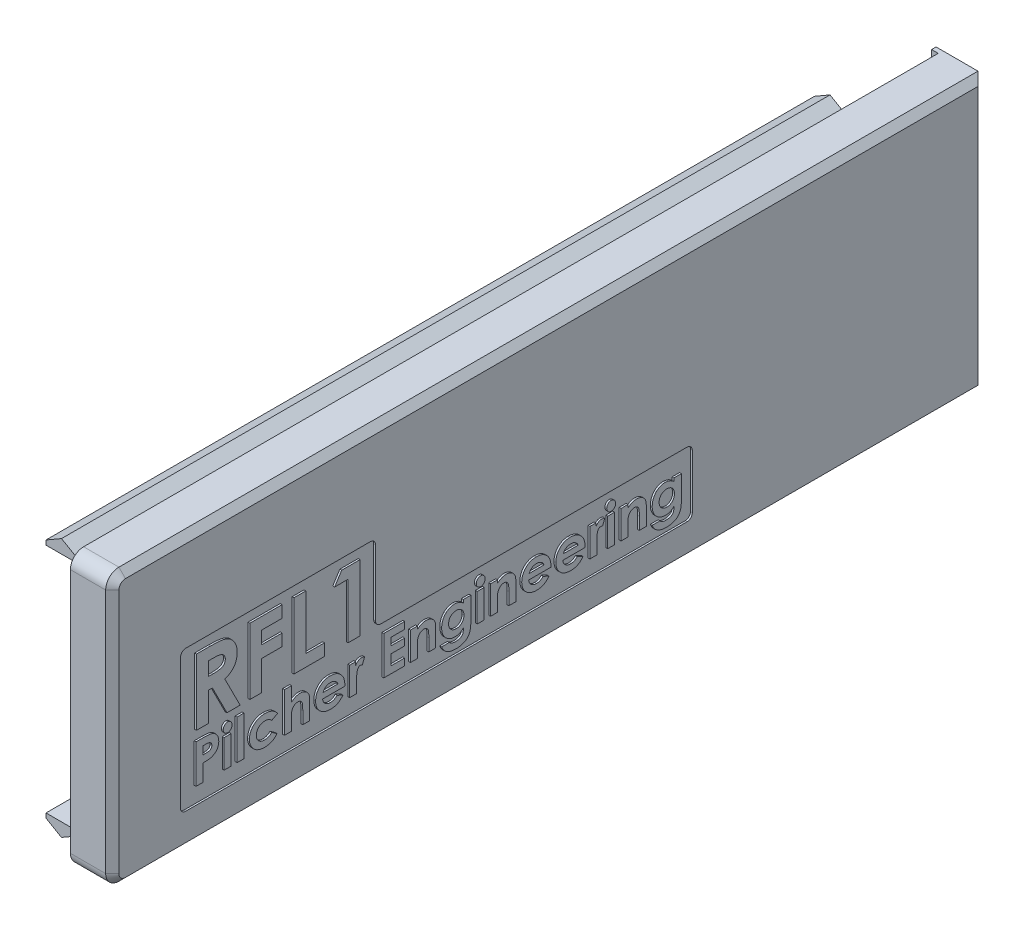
from build123d import *

# Parameters (mm, degrees)
SKETCH1_W           = 167.64
SKETCH1_H           = 52.28
BOSS_EXTRUDE1_DEPTH = 1.7
FILLET1_R           = 2.54
CHAMFER3_SIZE       = 1.27
SKETCH3_W           = 162.56
SKETCH3_H           = 47.2
EXTRUDE_THIN1_DEPTH = 6.35
CUT_EXTRUDE3_DEPTH  = 0.35
SKETCH2_W           = 1.329700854
SKETCH2_H           = 5.413782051
SKETCH2_W_2         = 1.329700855
SKETCH2_H_2         = 7.598290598
BOSS_EXTRUDE3_DEPTH = 0.35
FILLET2_R           = 1.016
BOSS_EXTRUDE4_START = -3.048
BOSS_EXTRUDE4_DEPTH = 161.544
SKETCH7_W           = 0.87
SKETCH7_H           = 42.02
BOSS_EXTRUDE5_DEPTH = 7.62
CUT_EXTRUDE4_REACH  = 177.06
SKETCH8_W           = 14.086254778
SKETCH8_H           = 13.861411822
CUT_EXTRUDE5_REACH  = 177.06
SKETCH9_W           = 14.086254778
SKETCH9_H           = 3.4520124
SKETCH11_W          = 1.27
SKETCH11_H          = 0.87
BOSS_EXTRUDE7_DEPTH = 52.28


with BuildPart() as part:
    # Sketch1 → Boss-Extrude1 (new body)
    with BuildSketch(Plane(origin=(0, 0, 0), x_dir=(0, 0, -1), z_dir=(1, 0, 0))):
        with Locations((-83.82, 26.14)):
            Rectangle(SKETCH1_W, SKETCH1_H)
    extrude(amount=BOSS_EXTRUDE1_DEPTH)

    # Fillet1
    fillet1_edges = [part.edges().sort_by_distance(p)[0] for p in [
        (0.85, 52.28, 167.64),
        (0.85, 0, 167.64),
    ]]
    fillet(fillet1_edges, radius=FILLET1_R)

    # Chamfer3
    chamfer3_edges = [part.edges().sort_by_distance(p)[0] for p in [
        (1.7, 26.14, 0),
        (1.7, 52.28, 82.55),
        (1.7, 0, 82.55),
        (1.7, 26.14, 167.64),
        (1.7, 51.536051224, 166.896051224),
        (1.7, 0.743948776, 166.896051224),
    ]]
    chamfer(chamfer3_edges, length=CHAMFER3_SIZE)

    # Sketch3 → Extrude-Thin1 (add)
    with BuildSketch(Plane.ZY):
        with BuildLine():
            Line((165.1, 52.28), (0, 52.28))
            Line((0, 52.28), (0, 0))
            Line((0, 0), (165.1, 0))
            ThreePointArc((165.1, 0), (166.896051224, 0.743948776), (167.64, 2.54))
            Line((167.64, 2.54), (167.64, 49.74))
            ThreePointArc((167.64, 49.74), (166.896051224, 51.536051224), (165.1, 52.28))
        make_face()
        with Locations((83.82, 26.14)):
            Rectangle(SKETCH3_W, SKETCH3_H, mode=Mode.SUBTRACT)
    extrude(amount=EXTRUDE_THIN1_DEPTH)

    # Sketch5 → Cut-Extrude3 (cut)
    with BuildSketch(Plane(origin=(1.7, 0, 0), x_dir=(0, 0, -1), z_dir=(1, 0, 0))):
        Polygon((-154.531989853, 33.626177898), (-117.051058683, 33.626177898), (-117.051058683, 18.93077481), (-56.172175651, 18.93077481), (-56.172175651, 6.507591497), (-154.531989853, 6.507591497), align=None)
    extrude(amount=-CUT_EXTRUDE3_DEPTH, mode=Mode.SUBTRACT)

    # Sketch2 → Boss-Extrude3 (add)
    # profile 1 of 25: a face of its own
    with BuildSketch(Plane(origin=(1.7, 0, 0), x_dir=(0, 0, -1), z_dir=(1, 0, 0))):
        with BuildLine():
            Line((-151.456115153, 31.63077481), (-148.800105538, 31.63077481))
            add(Edge.make_bspline(
                [(-148.800105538, 31.63077481), (-148.624544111, 31.630151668), (-148.286890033, 31.628953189), (-147.800011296, 31.610044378), (-147.352746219, 31.583731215), (-146.944432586, 31.543576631), (-146.575245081, 31.490336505), (-146.24481369, 31.427575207), (-145.953148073, 31.356045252), (-145.697788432, 31.266913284), (-145.467338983, 31.166373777), (-145.252528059, 31.050852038), (-145.048616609, 30.921634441), (-144.856967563, 30.77532092), (-144.675915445, 30.614543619), (-144.50511869, 30.439140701), (-144.346990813, 30.24762482), (-144.202510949, 30.041206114), (-144.070829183, 29.824058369), (-143.95445012, 29.595883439), (-143.859810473, 29.356522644), (-143.7761862, 29.109435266), (-143.715954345, 28.85108914), (-143.67406397, 28.583999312), (-143.643393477, 28.307225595), (-143.641630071, 28.119197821), (-143.640730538, 28.023282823)],
                knots=[0, 0, 0, 0, 1.749336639, 3.364467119, 4.854658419, 6.213483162, 7.451590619, 8.570285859, 9.5643256, 10.440900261, 11.26203566, 12.067320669, 12.869050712, 13.665104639, 14.467235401, 15.27997916, 16.102287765, 16.939272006, 17.78853747, 18.631303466, 19.488103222, 20.351255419, 21.228522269, 22.127379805, 23.044756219, 24, 24, 24, 24], degree=3))
            add(Edge.make_bspline(
                [(-143.640730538, 28.023282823), (-143.643067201, 27.923169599), (-143.64764897, 27.726865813), (-143.672328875, 27.438511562), (-143.717435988, 27.162634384), (-143.785757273, 26.900042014), (-143.864283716, 26.647466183), (-143.968703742, 26.409567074), (-144.086552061, 26.182884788), (-144.226517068, 25.970625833), (-144.380121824, 25.768075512), (-144.558760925, 25.582994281), (-144.7508613, 25.405434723), (-144.967221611, 25.246518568), (-145.198304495, 25.095500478), (-145.448701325, 24.958637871), (-145.716777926, 24.832490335), (-145.905249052, 24.762141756), (-146.001627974, 24.726167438)],
                knots=[0, 0, 0, 0, 1.099860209, 2.156625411, 3.176576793, 4.16617041, 5.135385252, 6.078461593, 7.016046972, 7.938469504, 8.868247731, 9.803980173, 10.76021508, 11.73834243, 12.748633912, 13.790971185, 14.870363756, 16, 16, 16, 16], degree=3))
            Line((-146.001627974, 24.726167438), (-143.070858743, 18.93077481))
            Line((-143.070858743, 18.93077481), (-145.604752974, 18.93077481))
            Line((-145.604752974, 18.93077481), (-148.403230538, 24.466672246))
            Line((-148.403230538, 24.466672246), (-149.176627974, 24.466672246))
            Line((-149.176627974, 24.466672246), (-149.176627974, 18.93077481))
            Line((-149.176627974, 18.93077481), (-151.456115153, 18.93077481))
            Line((-151.456115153, 18.93077481), (-151.456115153, 31.63077481))
        make_face()
        with BuildLine():
            Line((-149.176627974, 26.746159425), (-148.288747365, 26.746159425))
            add(Edge.make_bspline(
                [(-148.288747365, 26.746159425), (-148.18019658, 26.747381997), (-147.972345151, 26.74972296), (-147.673427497, 26.760581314), (-147.40193898, 26.786744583), (-147.156713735, 26.819800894), (-146.936517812, 26.85796918), (-146.74331528, 26.912666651), (-146.574129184, 26.971276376), (-146.430964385, 27.044113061), (-146.30864767, 27.126944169), (-146.203035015, 27.221042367), (-146.115678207, 27.329949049), (-146.043779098, 27.450704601), (-145.987849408, 27.584377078), (-145.947025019, 27.729499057), (-145.924210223, 27.887723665), (-145.921585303, 27.996920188), (-145.920217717, 28.053811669)],
                knots=[0, 0, 0, 0, 1.688639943, 3.233382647, 4.650958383, 5.928841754, 7.082724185, 8.122798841, 9.049171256, 9.863274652, 10.613301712, 11.341792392, 12.054588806, 12.776240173, 13.521029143, 14.301969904, 15.115324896, 16, 16, 16, 16], degree=3))
            add(Edge.make_bspline(
                [(-145.920217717, 28.053811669), (-145.922803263, 28.121118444), (-145.927882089, 28.25333013), (-145.978279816, 28.443668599), (-146.058502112, 28.619839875), (-146.168464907, 28.781047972), (-146.306948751, 28.922374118), (-146.465869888, 29.046954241), (-146.64865822, 29.145462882), (-146.81790646, 29.210438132), (-146.971882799, 29.249313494), (-147.110841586, 29.27828307), (-147.271756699, 29.298814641), (-147.454749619, 29.320592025), (-147.659353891, 29.334713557), (-147.88668473, 29.345019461), (-148.136089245, 29.349236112), (-148.309947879, 29.350584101), (-148.400686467, 29.35128763)],
                knots=[0, 0, 0, 0, 1.020303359, 2.004196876, 2.966617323, 3.9489082, 4.950758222, 5.960522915, 7.003732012, 8.091992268, 8.70421221, 9.413913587, 10.24622431, 11.166358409, 12.212345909, 13.359657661, 14.621978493, 16, 16, 16, 16], degree=3))
            Line((-148.400686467, 29.35128763), (-149.176627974, 29.35128763))
            Line((-149.176627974, 29.35128763), (-149.176627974, 26.746159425))
        make_face(mode=Mode.SUBTRACT)
    # profile 2 of 25: a face of its own
    with BuildSketch(Plane(origin=(1.7, 0, 0), x_dir=(0, 0, -1), z_dir=(1, 0, 0))):
        Polygon((-141.198422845, 31.63077481), (-135.011243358, 31.63077481), (-135.011243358, 29.35128763), (-138.918935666, 29.35128763), (-138.918935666, 26.908979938), (-135.011243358, 26.908979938), (-135.011243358, 24.629492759), (-138.918935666, 24.629492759), (-138.918935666, 18.93077481), (-141.198422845, 18.93077481), align=None)
    # profile 3 of 25: a face of its own
    with BuildSketch(Plane(origin=(1.7, 0, 0), x_dir=(0, 0, -1), z_dir=(1, 0, 0))):
        Polygon((-132.731756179, 31.63077481), (-130.452268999, 31.63077481), (-130.452268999, 21.210261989), (-126.870217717, 21.210261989), (-126.870217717, 18.93077481), (-132.731756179, 18.93077481), align=None)
    # profile 4 of 25: a face of its own
    with BuildSketch(Plane(origin=(1.7, 0, 0), x_dir=(0, 0, -1), z_dir=(1, 0, 0))):
        Polygon((-123.555293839, 31.63077481), (-120.031756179, 31.63077481), (-120.031756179, 18.93077481), (-122.311243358, 18.93077481), (-122.311243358, 29.514108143), (-124.916371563, 29.514108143), align=None)
    # profile 5 of 25: a face of its own
    with BuildSketch(Plane(origin=(1.7, 0, 0), x_dir=(0, 0, -1), z_dir=(1, 0, 0))):
        with BuildLine():
            Line((-151.545192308, 17.060333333), (-150.061151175, 17.060333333))
            add(Edge.make_bspline(
                [(-150.061151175, 17.060333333), (-149.964185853, 17.059899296), (-149.777119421, 17.059061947), (-149.507354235, 17.048907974), (-149.258482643, 17.030711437), (-149.030561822, 17.008223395), (-148.823685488, 16.976696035), (-148.637594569, 16.940552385), (-148.472250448, 16.896518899), (-148.325788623, 16.844251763), (-148.194343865, 16.782630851), (-148.06995473, 16.717000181), (-147.955432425, 16.638672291), (-147.844996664, 16.556089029), (-147.744961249, 16.461361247), (-147.649085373, 16.360793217), (-147.561429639, 16.250396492), (-147.481587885, 16.131507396), (-147.409159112, 16.006322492), (-147.34588049, 15.874617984), (-147.294552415, 15.736185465), (-147.251494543, 15.591920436), (-147.216910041, 15.441829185), (-147.193889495, 15.284988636), (-147.178252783, 15.122493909), (-147.176873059, 15.011899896), (-147.176175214, 14.955963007)],
                knots=[0, 0, 0, 0, 1.698747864, 3.27724071, 4.728299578, 6.070144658, 7.288476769, 8.393259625, 9.389771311, 10.283485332, 11.113357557, 11.931608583, 12.74405601, 13.541433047, 14.344816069, 15.154114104, 15.974336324, 16.810834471, 17.661136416, 18.50621059, 19.367396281, 20.244825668, 21.142564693, 22.063065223, 23.020325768, 24, 24, 24, 24], degree=3))
            add(Edge.make_bspline(
                [(-147.176175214, 14.955963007), (-147.177184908, 14.894081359), (-147.179169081, 14.772476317), (-147.198620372, 14.594218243), (-147.231849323, 14.424265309), (-147.275277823, 14.261184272), (-147.335835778, 14.107658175), (-147.405020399, 13.960023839), (-147.490139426, 13.822420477), (-147.587401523, 13.693126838), (-147.693622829, 13.571091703), (-147.811325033, 13.459838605), (-147.93826468, 13.358609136), (-148.073706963, 13.266342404), (-148.218160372, 13.183224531), (-148.371520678, 13.108477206), (-148.534835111, 13.044491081), (-148.648562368, 13.011026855), (-148.706221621, 12.99406063)],
                knots=[0, 0, 0, 0, 1.102006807, 2.165578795, 3.188629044, 4.184801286, 5.166646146, 6.124351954, 7.085497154, 8.042432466, 9.003981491, 9.963833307, 10.922997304, 11.89326795, 12.880200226, 13.889073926, 14.929769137, 16, 16, 16, 16], degree=3))
            add(Edge.make_bspline(
                [(-148.706221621, 12.99406063), (-148.744199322, 12.984611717), (-148.826471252, 12.964142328), (-148.962608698, 12.94336076), (-149.119492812, 12.924253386), (-149.297630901, 12.907832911), (-149.497125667, 12.896670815), (-149.717783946, 12.887953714), (-149.959705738, 12.881615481), (-150.127928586, 12.881390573), (-150.215491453, 12.881273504)],
                knots=[0, 0, 0, 0, 0.618981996, 1.340914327, 2.176866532, 3.120127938, 4.170906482, 5.338178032, 6.614476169, 8, 8, 8, 8], degree=3))
            Line((-150.215491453, 12.881273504), (-150.215491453, 9.652))
            Line((-150.215491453, 9.652), (-151.545192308, 9.652))
            Line((-151.545192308, 9.652), (-151.545192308, 17.060333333))
        make_face()
        with BuildLine():
            Line((-150.215491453, 14.210974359), (-149.745050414, 14.210974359))
            add(Edge.make_bspline(
                [(-149.745050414, 14.210974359), (-149.65944624, 14.211517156), (-149.501933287, 14.21251591), (-149.286826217, 14.226958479), (-149.113962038, 14.249015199), (-148.977396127, 14.280649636), (-148.869564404, 14.328659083), (-148.776566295, 14.384196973), (-148.696799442, 14.45442311), (-148.627733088, 14.534668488), (-148.57251662, 14.626874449), (-148.534226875, 14.729539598), (-148.509354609, 14.84050683), (-148.507057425, 14.917732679), (-148.505876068, 14.957447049)],
                knots=[0, 0, 0, 0, 1.8619151, 3.425951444, 4.686033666, 5.651700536, 6.461346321, 7.243864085, 7.999046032, 8.762387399, 9.539336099, 10.322741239, 11.137448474, 12, 12, 12, 12], degree=3))
            add(Edge.make_bspline(
                [(-148.505876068, 14.957447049), (-148.507045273, 14.992144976), (-148.509313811, 15.059467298), (-148.525979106, 15.156630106), (-148.552538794, 15.247205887), (-148.59102276, 15.330248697), (-148.640773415, 15.405617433), (-148.701429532, 15.473282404), (-148.772212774, 15.534692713), (-148.826861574, 15.567198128), (-148.854625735, 15.583712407)],
                knots=[0, 0, 0, 0, 1.102301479, 2.1387299, 3.123554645, 4.094223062, 5.036071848, 5.982632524, 6.975082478, 8, 8, 8, 8], degree=3))
            add(Edge.make_bspline(
                [(-148.854625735, 15.583712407), (-148.878143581, 15.595606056), (-148.92793568, 15.620787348), (-149.012736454, 15.650062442), (-149.110595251, 15.674759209), (-149.22217273, 15.695257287), (-149.347023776, 15.711165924), (-149.485126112, 15.723332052), (-149.636682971, 15.728224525), (-149.742081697, 15.729807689), (-149.796991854, 15.730632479)],
                knots=[0, 0, 0, 0, 0.656809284, 1.390599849, 2.23162475, 3.173112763, 4.218524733, 5.370385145, 6.63003504, 8, 8, 8, 8], degree=3))
            Line((-149.796991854, 15.730632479), (-150.215491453, 15.730632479))
            Line((-150.215491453, 15.730632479), (-150.215491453, 14.210974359))
        make_face(mode=Mode.SUBTRACT)
    # profile 6 of 25: a face of its own
    with BuildSketch(Plane(origin=(1.7, 0, 0), x_dir=(0, 0, -1), z_dir=(1, 0, 0))):
        with BuildLine():
            add(Edge.make_bspline(
                [(-145.469527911, 17.345269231), (-145.412217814, 17.34245738), (-145.299683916, 17.336936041), (-145.138463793, 17.283115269), (-144.990496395, 17.198645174), (-144.859689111, 17.082750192), (-144.750895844, 16.944350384), (-144.667773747, 16.789402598), (-144.62146989, 16.617725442), (-144.615038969, 16.499132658), (-144.611752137, 16.438520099)],
                knots=[0, 0, 0, 0, 0.989868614, 1.943702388, 2.910836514, 3.924849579, 4.949916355, 5.946401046, 6.950409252, 8, 8, 8, 8], degree=3))
            add(Edge.make_bspline(
                [(-144.611752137, 16.438520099), (-144.614921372, 16.37835422), (-144.621096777, 16.261118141), (-144.668839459, 16.091771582), (-144.748625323, 15.936899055), (-144.858299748, 15.800554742), (-144.98768891, 15.686526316), (-145.132423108, 15.600522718), (-145.292098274, 15.549695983), (-145.402885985, 15.543713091), (-145.459139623, 15.540675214)],
                knots=[0, 0, 0, 0, 1.05296456, 2.051751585, 3.055639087, 4.085634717, 5.099016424, 6.062201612, 7.016062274, 8, 8, 8, 8], degree=3))
            add(Edge.make_bspline(
                [(-145.459139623, 15.540675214), (-145.51694999, 15.543477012), (-145.630462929, 15.548978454), (-145.793005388, 15.602925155), (-145.942946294, 15.686729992), (-146.073186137, 15.80499289), (-146.18322533, 15.944376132), (-146.26271662, 16.102931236), (-146.312440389, 16.275782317), (-146.318342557, 16.396131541), (-146.321367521, 16.457812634)],
                knots=[0, 0, 0, 0, 0.989065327, 1.942068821, 2.907541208, 3.917690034, 4.939857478, 5.938239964, 6.943311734, 8, 8, 8, 8], degree=3))
            add(Edge.make_bspline(
                [(-146.321367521, 16.457812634), (-146.318075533, 16.516956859), (-146.311608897, 16.633137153), (-146.265027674, 16.800997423), (-146.183811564, 16.953340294), (-146.075801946, 17.089206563), (-145.94614359, 17.202939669), (-145.798265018, 17.284844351), (-145.638129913, 17.336442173), (-145.526308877, 17.342296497), (-145.469527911, 17.345269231)],
                knots=[0, 0, 0, 0, 1.038616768, 2.040212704, 3.031499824, 4.052181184, 5.074969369, 6.039807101, 7.004644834, 8, 8, 8, 8], degree=3))
        make_face()
    # profile 7 of 25: a face of its own
    with BuildSketch(Plane(origin=(1.7, 0, 0), x_dir=(0, 0, -1), z_dir=(1, 0, 0))):
        with Locations((-145.466559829, 12.358891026)):
            Rectangle(SKETCH2_W, SKETCH2_H)
    # profile 8 of 25: a face of its own
    with BuildSketch(Plane(origin=(1.7, 0, 0), x_dir=(0, 0, -1), z_dir=(1, 0, 0))):
        with Locations((-142.997115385, 13.451145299)):
            Rectangle(SKETCH2_W_2, SKETCH2_H_2)
    # profile 9 of 25: a face of its own
    with BuildSketch(Plane(origin=(1.7, 0, 0), x_dir=(0, 0, -1), z_dir=(1, 0, 0))):
        with BuildLine():
            Line((-135.873717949, 13.961655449), (-136.974876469, 13.356166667))
            add(Edge.make_bspline(
                [(-136.974876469, 13.356166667), (-137.025349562, 13.406711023), (-137.122371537, 13.503869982), (-137.277954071, 13.62685781), (-137.430756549, 13.728688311), (-137.587078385, 13.80383399), (-137.748316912, 13.860425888), (-137.920287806, 13.897907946), (-138.10499827, 13.922588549), (-138.232762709, 13.924864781), (-138.298641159, 13.926038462)],
                knots=[0, 0, 0, 0, 1.150764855, 2.212059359, 3.192108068, 4.105322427, 5.000809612, 5.941206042, 6.938435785, 8, 8, 8, 8], degree=3))
            add(Edge.make_bspline(
                [(-138.298641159, 13.926038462), (-138.359056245, 13.924579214), (-138.477283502, 13.92172359), (-138.650032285, 13.900394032), (-138.814212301, 13.866893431), (-138.969528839, 13.817881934), (-139.115705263, 13.75313508), (-139.25395039, 13.676516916), (-139.382920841, 13.585034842), (-139.500793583, 13.479989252), (-139.607194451, 13.364336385), (-139.702109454, 13.240987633), (-139.779867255, 13.108113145), (-139.847093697, 12.968835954), (-139.896519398, 12.820540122), (-139.932680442, 12.66457128), (-139.953291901, 12.500922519), (-139.956278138, 12.389122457), (-139.957799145, 12.332178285)],
                knots=[0, 0, 0, 0, 1.121765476, 2.195200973, 3.227634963, 4.230038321, 5.213228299, 6.192116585, 7.160777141, 8.14345191, 9.118668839, 10.075979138, 11.027630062, 11.972829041, 12.943187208, 13.923755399, 14.94248691, 16, 16, 16, 16], degree=3))
            add(Edge.make_bspline(
                [(-139.957799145, 12.332178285), (-139.95619207, 12.276720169), (-139.953054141, 12.168434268), (-139.933775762, 12.009336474), (-139.900307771, 11.857882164), (-139.850126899, 11.714872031), (-139.789979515, 11.578987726), (-139.71444541, 11.451309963), (-139.625621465, 11.331281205), (-139.523040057, 11.219944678), (-139.409405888, 11.119811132), (-139.286899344, 11.031382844), (-139.155885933, 10.956412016), (-139.014839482, 10.897576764), (-138.866059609, 10.849638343), (-138.708552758, 10.81550431), (-138.542486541, 10.796557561), (-138.429283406, 10.793373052), (-138.371359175, 10.79174359)],
                knots=[0, 0, 0, 0, 1.070556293, 2.090336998, 3.088792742, 4.058148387, 5.011235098, 5.952916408, 6.915475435, 7.888633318, 8.869583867, 9.83422472, 10.800707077, 11.776204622, 12.778807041, 13.814557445, 14.881744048, 16, 16, 16, 16], degree=3))
            add(Edge.make_bspline(
                [(-138.371359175, 10.79174359), (-138.300040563, 10.793375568), (-138.160836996, 10.796560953), (-137.958475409, 10.823578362), (-137.768055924, 10.868255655), (-137.589558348, 10.930092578), (-137.423232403, 11.010945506), (-137.26950545, 11.109701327), (-137.126797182, 11.225631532), (-137.043577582, 11.316013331), (-137.001589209, 11.361615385)],
                knots=[0, 0, 0, 0, 1.116373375, 2.178998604, 3.189797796, 4.174590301, 5.13072713, 6.078291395, 7.030403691, 8, 8, 8, 8], degree=3))
            Line((-137.001589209, 11.361615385), (-135.968696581, 10.652243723))
            add(Edge.make_bspline(
                [(-135.968696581, 10.652243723), (-136.040291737, 10.564709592), (-136.181579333, 10.391967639), (-136.428087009, 10.169309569), (-136.693403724, 9.977996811), (-136.98286557, 9.825293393), (-137.292257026, 9.703837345), (-137.623995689, 9.617979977), (-137.977520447, 9.567439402), (-138.22031503, 9.560549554), (-138.344646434, 9.557021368)],
                knots=[0, 0, 0, 0, 0.997876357, 1.969233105, 2.924898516, 3.881013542, 4.852507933, 5.855329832, 6.901747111, 8, 8, 8, 8], degree=3))
            add(Edge.make_bspline(
                [(-138.344646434, 9.557021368), (-138.456552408, 9.559608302), (-138.675117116, 9.564660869), (-138.993669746, 9.603354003), (-139.293285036, 9.668527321), (-139.57457934, 9.759039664), (-139.8372962, 9.87628704), (-140.080583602, 10.021717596), (-140.306082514, 10.191285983), (-140.509724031, 10.385793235), (-140.69141899, 10.597516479), (-140.850039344, 10.820494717), (-140.987221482, 11.05073283), (-141.094840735, 11.292063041), (-141.182795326, 11.540723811), (-141.242197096, 11.799687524), (-141.281376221, 12.066821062), (-141.285442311, 12.247940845), (-141.2875, 12.339598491)],
                knots=[0, 0, 0, 0, 1.183377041, 2.311265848, 3.387807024, 4.421911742, 5.431260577, 6.423665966, 7.413571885, 8.409103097, 9.395976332, 10.359992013, 11.300391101, 12.225292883, 13.150239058, 14.085544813, 15.031169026, 16, 16, 16, 16], degree=3))
            add(Edge.make_bspline(
                [(-141.2875, 12.339598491), (-141.286397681, 12.40345715), (-141.284214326, 12.529941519), (-141.26557538, 12.717784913), (-141.236579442, 12.902440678), (-141.193001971, 13.08261263), (-141.139409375, 13.259174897), (-141.074260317, 13.432091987), (-140.994985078, 13.600471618), (-140.906553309, 13.765746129), (-140.80576572, 13.923552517), (-140.695808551, 14.073821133), (-140.576836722, 14.215631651), (-140.447452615, 14.347662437), (-140.308558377, 14.470858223), (-140.162173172, 14.587718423), (-140.003560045, 14.692216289), (-139.838233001, 14.790463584), (-139.664767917, 14.8779226), (-139.485158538, 14.953411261), (-139.300792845, 15.017549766), (-139.111228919, 15.069118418), (-138.91728041, 15.111620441), (-138.717221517, 15.138593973), (-138.512707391, 15.157553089), (-138.374372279, 15.159685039), (-138.304577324, 15.160760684)],
                knots=[0, 0, 0, 0, 1.00272354, 1.986087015, 2.96193297, 3.936200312, 4.894695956, 5.858592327, 6.835334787, 7.815655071, 8.800643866, 9.773423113, 10.738352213, 11.705312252, 12.673769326, 13.65298065, 14.64420052, 15.654211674, 16.672258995, 17.692438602, 18.712115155, 19.735602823, 20.776372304, 21.827874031, 22.90408564, 24, 24, 24, 24], degree=3))
            add(Edge.make_bspline(
                [(-138.304577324, 15.160760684), (-138.239746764, 15.160027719), (-138.111887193, 15.158582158), (-137.923067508, 15.143466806), (-137.739398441, 15.117792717), (-137.56056742, 15.083826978), (-137.386031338, 15.041737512), (-137.218129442, 14.985633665), (-137.054566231, 14.921957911), (-136.843895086, 14.825814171), (-136.595552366, 14.682304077), (-136.322938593, 14.476478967), (-136.079870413, 14.235693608), (-135.942800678, 14.053487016), (-135.873717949, 13.961655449)],
                knots=[0, 0, 0, 0, 0.826738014, 1.630502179, 2.413926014, 3.191023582, 3.95155221, 4.701751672, 5.446919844, 6.189438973, 7.653650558, 9.094719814, 10.535747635, 12, 12, 12, 12], degree=3))
        make_face()
    # profile 10 of 25: a face of its own
    with BuildSketch(Plane(origin=(1.7, 0, 0), x_dir=(0, 0, -1), z_dir=(1, 0, 0))):
        with BuildLine():
            Line((-134.544017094, 17.250290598), (-133.214316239, 17.250290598))
            Line((-133.214316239, 17.250290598), (-133.214316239, 14.479585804))
            add(Edge.make_bspline(
                [(-133.214316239, 14.479585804), (-133.147336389, 14.534057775), (-133.016781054, 14.640233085), (-132.811935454, 14.77855432), (-132.607513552, 14.896589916), (-132.401346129, 14.992249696), (-132.194327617, 15.067212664), (-131.986100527, 15.12037515), (-131.776464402, 15.155254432), (-131.635927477, 15.158923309), (-131.565546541, 15.160760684)],
                knots=[0, 0, 0, 0, 1.13710654, 2.216417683, 3.252896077, 4.244436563, 5.207303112, 6.149540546, 7.073289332, 8, 8, 8, 8], degree=3))
            add(Edge.make_bspline(
                [(-131.565546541, 15.160760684), (-131.49819671, 15.158973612), (-131.365983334, 15.155465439), (-131.172018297, 15.130125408), (-130.986238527, 15.08652175), (-130.808186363, 15.026580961), (-130.639086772, 14.945969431), (-130.476740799, 14.851543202), (-130.323078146, 14.738411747), (-130.229583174, 14.651204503), (-130.182420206, 14.607213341)],
                knots=[0, 0, 0, 0, 1.056403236, 2.073808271, 3.062028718, 4.046096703, 5.014652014, 5.995532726, 6.988858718, 8, 8, 8, 8], degree=3))
            add(Edge.make_bspline(
                [(-130.182420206, 14.607213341), (-130.143686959, 14.56610763), (-130.065658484, 14.483299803), (-129.968476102, 14.340541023), (-129.884560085, 14.185041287), (-129.816180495, 14.015339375), (-129.765325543, 13.831356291), (-129.725953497, 13.634607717), (-129.704179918, 13.422945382), (-129.701492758, 13.27706507), (-129.700106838, 13.201826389)],
                knots=[0, 0, 0, 0, 0.887296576, 1.787466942, 2.706642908, 3.663267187, 4.658426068, 5.705361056, 6.816525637, 8, 8, 8, 8], degree=3))
            Line((-129.700106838, 13.201826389), (-129.700106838, 9.652))
            Line((-129.700106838, 9.652), (-131.029807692, 9.652))
            Line((-131.029807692, 9.652), (-131.029807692, 12.005689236))
            add(Edge.make_bspline(
                [(-131.029807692, 12.005689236), (-131.030066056, 12.080388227), (-131.030560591, 12.223369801), (-131.035001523, 12.428695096), (-131.042253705, 12.615225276), (-131.052171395, 12.783016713), (-131.066018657, 12.931368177), (-131.079638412, 13.061342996), (-131.09875012, 13.172318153), (-131.127367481, 13.292903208), (-131.173939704, 13.421878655), (-131.241616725, 13.559360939), (-131.332014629, 13.672826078), (-131.436627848, 13.76640637), (-131.557585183, 13.83783039), (-131.690556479, 13.890582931), (-131.837814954, 13.920249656), (-131.939887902, 13.92405846), (-131.992950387, 13.926038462)],
                knots=[0, 0, 0, 0, 1.461461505, 2.797388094, 4.017818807, 5.113567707, 6.085313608, 6.932873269, 7.669572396, 8.286941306, 9.355291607, 10.346554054, 11.270113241, 12.175128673, 13.078071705, 14.003657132, 14.962203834, 16, 16, 16, 16], degree=3))
            add(Edge.make_bspline(
                [(-131.992950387, 13.926038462), (-132.062075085, 13.923336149), (-132.197463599, 13.918043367), (-132.391616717, 13.863560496), (-132.570697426, 13.777443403), (-132.732615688, 13.658088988), (-132.87371027, 13.50859283), (-132.991925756, 13.333368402), (-133.088619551, 13.13416833), (-133.13041235, 12.988908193), (-133.151986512, 12.913922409)],
                knots=[0, 0, 0, 0, 0.993549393, 1.945978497, 2.879753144, 3.843180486, 4.826017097, 5.826060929, 6.877775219, 8, 8, 8, 8], degree=3))
            add(Edge.make_bspline(
                [(-133.151986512, 12.913922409), (-133.157358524, 12.890745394), (-133.16960847, 12.837894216), (-133.178989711, 12.747721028), (-133.192911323, 12.638717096), (-133.197740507, 12.510229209), (-133.206786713, 12.362455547), (-133.210040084, 12.195157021), (-133.213315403, 12.008176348), (-133.213971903, 11.877074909), (-133.214316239, 11.808311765)],
                knots=[0, 0, 0, 0, 0.514379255, 1.17295301, 1.959069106, 2.891908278, 3.953016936, 5.163065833, 6.51201855, 8, 8, 8, 8], degree=3))
            Line((-133.214316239, 11.808311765), (-133.214316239, 9.652))
            Line((-133.214316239, 9.652), (-134.544017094, 9.652))
            Line((-134.544017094, 9.652), (-134.544017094, 17.250290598))
        make_face()
    # profile 11 of 25: a face of its own
    with BuildSketch(Plane(origin=(1.7, 0, 0), x_dir=(0, 0, -1), z_dir=(1, 0, 0))):
        with BuildLine():
            Line((-122.961076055, 12.026465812), (-127.230662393, 12.026465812))
            add(Edge.make_bspline(
                [(-127.230662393, 12.026465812), (-127.221957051, 11.976855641), (-127.204850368, 11.879367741), (-127.167702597, 11.737758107), (-127.120296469, 11.604307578), (-127.063483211, 11.478837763), (-126.998220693, 11.360685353), (-126.922097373, 11.250404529), (-126.836078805, 11.148092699), (-126.740662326, 11.054194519), (-126.637438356, 10.970059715), (-126.526907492, 10.896352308), (-126.408955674, 10.835916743), (-126.284935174, 10.784975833), (-126.153919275, 10.744625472), (-126.015715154, 10.716796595), (-125.870689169, 10.700357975), (-125.771893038, 10.697980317), (-125.721392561, 10.696764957)],
                knots=[0, 0, 0, 0, 1.091296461, 2.144483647, 3.168565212, 4.157007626, 5.126487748, 6.090021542, 7.05641414, 8.019231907, 8.98705074, 9.938580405, 10.892824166, 11.854447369, 12.841318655, 13.858982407, 14.905600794, 16, 16, 16, 16], degree=3))
            add(Edge.make_bspline(
                [(-125.721392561, 10.696764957), (-125.660435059, 10.698374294), (-125.540391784, 10.701543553), (-125.364527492, 10.729650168), (-125.194441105, 10.772103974), (-125.031742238, 10.835236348), (-124.87454628, 10.913825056), (-124.72544116, 11.011736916), (-124.581845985, 11.126110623), (-124.494236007, 11.214269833), (-124.449569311, 11.259216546)],
                knots=[0, 0, 0, 0, 1.021034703, 2.010718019, 2.977989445, 3.954245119, 4.929443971, 5.918328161, 6.938689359, 8, 8, 8, 8], degree=3))
            Line((-124.449569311, 11.259216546), (-123.336538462, 10.729413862))
            add(Edge.make_bspline(
                [(-123.336538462, 10.729413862), (-123.371581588, 10.680989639), (-123.441018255, 10.585038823), (-123.554371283, 10.450011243), (-123.672662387, 10.324025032), (-123.795979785, 10.207908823), (-123.924479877, 10.101993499), (-124.057805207, 10.004988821), (-124.197904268, 9.919499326), (-124.341975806, 9.841389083), (-124.492998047, 9.774425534), (-124.650553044, 9.717321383), (-124.813973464, 9.665699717), (-124.985322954, 9.626366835), (-125.163174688, 9.595231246), (-125.347954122, 9.573120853), (-125.539636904, 9.559464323), (-125.669922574, 9.557845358), (-125.736232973, 9.557021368)],
                knots=[0, 0, 0, 0, 1.028154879, 2.037251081, 3.030720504, 4.000128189, 4.949298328, 5.894184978, 6.834267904, 7.770992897, 8.712077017, 9.673380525, 10.653304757, 11.658697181, 12.695551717, 13.758623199, 14.859225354, 16, 16, 16, 16], degree=3))
            add(Edge.make_bspline(
                [(-125.736232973, 9.557021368), (-125.838250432, 9.559101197), (-126.038045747, 9.563174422), (-126.330282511, 9.600979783), (-126.607826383, 9.663665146), (-126.871461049, 9.74887627), (-127.120046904, 9.861381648), (-127.353706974, 9.998985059), (-127.574775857, 10.159048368), (-127.776498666, 10.34493088), (-127.960274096, 10.547252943), (-128.121691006, 10.764533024), (-128.256762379, 10.995253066), (-128.367685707, 11.237886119), (-128.453899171, 11.493053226), (-128.516054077, 11.760865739), (-128.554155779, 12.041195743), (-128.558270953, 12.232131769), (-128.560363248, 12.329210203)],
                knots=[0, 0, 0, 0, 1.103565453, 2.161269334, 3.182010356, 4.179077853, 5.15417608, 6.128274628, 7.109042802, 8.101804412, 9.090965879, 10.063106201, 11.02526161, 11.978650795, 12.945248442, 13.93468508, 14.949922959, 16, 16, 16, 16], degree=3))
            add(Edge.make_bspline(
                [(-128.560363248, 12.329210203), (-128.55825036, 12.428755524), (-128.554093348, 12.624606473), (-128.516382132, 12.911409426), (-128.453727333, 13.185058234), (-128.367261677, 13.445929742), (-128.258021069, 13.694839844), (-128.121231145, 13.929610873), (-127.960354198, 14.151060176), (-127.777240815, 14.358151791), (-127.574663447, 14.545074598), (-127.359405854, 14.711660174), (-127.129049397, 14.850470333), (-126.886199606, 14.962628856), (-126.632409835, 15.053754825), (-126.36474663, 15.114391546), (-126.085246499, 15.155105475), (-125.894186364, 15.158854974), (-125.797078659, 15.160760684)],
                knots=[0, 0, 0, 0, 1.079208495, 2.12329425, 3.130605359, 4.119693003, 5.099659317, 6.073216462, 7.060498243, 8.06384408, 9.066070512, 10.045757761, 11.010926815, 11.975797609, 12.942977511, 13.929384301, 14.947594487, 16, 16, 16, 16], degree=3))
            add(Edge.make_bspline(
                [(-125.797078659, 15.160760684), (-125.694572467, 15.158648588), (-125.493312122, 15.154501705), (-125.199040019, 15.117003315), (-124.919653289, 15.053935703), (-124.65396159, 14.969461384), (-124.405357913, 14.854114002), (-124.168379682, 14.719896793), (-123.948710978, 14.556373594), (-123.744010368, 14.371400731), (-123.559226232, 14.166179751), (-123.397704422, 13.943246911), (-123.260269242, 13.704777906), (-123.148876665, 13.449805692), (-123.062751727, 13.179095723), (-123.000539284, 12.892999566), (-122.962728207, 12.590429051), (-122.958689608, 12.383241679), (-122.956623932, 12.277268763)],
                knots=[0, 0, 0, 0, 1.080001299, 2.120471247, 3.119684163, 4.095710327, 5.052285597, 6.002875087, 6.961153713, 7.931888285, 8.906493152, 9.865905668, 10.82813294, 11.801621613, 12.7925306, 13.817193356, 14.883530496, 16, 16, 16, 16], degree=3))
            Line((-122.956623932, 12.277268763), (-122.961076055, 12.026465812))
        make_face()
        with BuildLine():
            add(Edge.make_bspline(
                [(-124.286324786, 13.071230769), (-124.311417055, 13.138944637), (-124.361307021, 13.273577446), (-124.474006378, 13.459337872), (-124.623554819, 13.620213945), (-124.797490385, 13.762638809), (-124.996222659, 13.878239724), (-125.213489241, 13.961938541), (-125.446543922, 14.012125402), (-125.606872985, 14.018011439), (-125.688743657, 14.021017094)],
                knots=[0, 0, 0, 0, 0.954238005, 1.897273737, 2.851915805, 3.847685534, 4.862635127, 5.880135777, 6.917509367, 8, 8, 8, 8], degree=3))
            add(Edge.make_bspline(
                [(-125.688743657, 14.021017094), (-125.77815976, 14.018129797), (-125.952949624, 14.012485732), (-126.205072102, 13.952459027), (-126.442892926, 13.862870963), (-126.583098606, 13.770503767), (-126.653370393, 13.724208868)],
                knots=[0, 0, 0, 0, 1.044195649, 2.041185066, 3.018232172, 4, 4, 4, 4], degree=3))
            add(Edge.make_bspline(
                [(-126.653370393, 13.724208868), (-126.697214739, 13.688949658), (-126.790688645, 13.613778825), (-126.912083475, 13.46382015), (-127.031658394, 13.282253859), (-127.099643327, 13.144341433), (-127.135683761, 13.071230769)],
                knots=[0, 0, 0, 0, 0.82159062, 1.751589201, 2.808063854, 4, 4, 4, 4], degree=3))
            Line((-127.135683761, 13.071230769), (-124.286324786, 13.071230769))
        make_face(mode=Mode.SUBTRACT)
    # profile 12 of 25: a face of its own
    with BuildSketch(Plane(origin=(1.7, 0, 0), x_dir=(0, 0, -1), z_dir=(1, 0, 0))):
        with BuildLine():
            Line((-122.006837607, 15.065782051), (-120.867094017, 15.065782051))
            Line((-120.867094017, 15.065782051), (-120.867094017, 14.399447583))
            add(Edge.make_bspline(
                [(-120.867094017, 14.399447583), (-120.834852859, 14.45866491), (-120.771836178, 14.574407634), (-120.656069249, 14.729769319), (-120.523071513, 14.860610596), (-120.377621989, 14.969668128), (-120.219279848, 15.054667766), (-120.052285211, 15.115240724), (-119.878066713, 15.154604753), (-119.75922076, 15.158693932), (-119.699153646, 15.160760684)],
                knots=[0, 0, 0, 0, 1.09866127, 2.147379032, 3.14564304, 4.131443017, 5.102343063, 6.064490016, 7.021754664, 8, 8, 8, 8], degree=3))
            add(Edge.make_bspline(
                [(-119.699153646, 15.160760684), (-119.655537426, 15.158718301), (-119.566719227, 15.15455928), (-119.431347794, 15.130382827), (-119.29402319, 15.086667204), (-119.203651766, 15.047307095), (-119.157478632, 15.027196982)],
                knots=[0, 0, 0, 0, 0.931404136, 1.896671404, 2.925354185, 4, 4, 4, 4], degree=3))
            Line((-119.157478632, 15.027196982), (-119.570042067, 13.900809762))
            add(Edge.make_bspline(
                [(-119.570042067, 13.900809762), (-119.606919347, 13.918627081), (-119.676234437, 13.952116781), (-119.776867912, 13.991638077), (-119.868196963, 14.01575204), (-119.926097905, 14.019350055), (-119.952924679, 14.021017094)],
                knots=[0, 0, 0, 0, 1.214386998, 2.282580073, 3.20428172, 4, 4, 4, 4], degree=3))
            add(Edge.make_bspline(
                [(-119.952924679, 14.021017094), (-119.978254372, 14.019912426), (-120.028082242, 14.017739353), (-120.101626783, 13.99911686), (-120.170890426, 13.967002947), (-120.239210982, 13.925861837), (-120.301198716, 13.868672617), (-120.363148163, 13.802465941), (-120.417741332, 13.720724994), (-120.475352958, 13.629743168), (-120.524407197, 13.518381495), (-120.566469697, 13.385438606), (-120.603947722, 13.229376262), (-120.62973772, 13.049365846), (-120.654664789, 12.847149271), (-120.669501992, 12.621242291), (-120.680560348, 12.372359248), (-120.681236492, 12.198629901), (-120.681588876, 12.108088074)],
                knots=[0, 0, 0, 0, 0.544232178, 1.070598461, 1.618251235, 2.182094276, 2.777567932, 3.425210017, 4.127676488, 4.886675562, 5.738955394, 6.734782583, 7.883056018, 9.186093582, 10.642914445, 12.264202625, 14.053029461, 16, 16, 16, 16], degree=3))
            Line((-120.681588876, 12.108088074), (-120.677136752, 11.843928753))
            Line((-120.677136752, 11.843928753), (-120.677136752, 9.652))
            Line((-120.677136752, 9.652), (-122.006837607, 9.652))
            Line((-122.006837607, 9.652), (-122.006837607, 15.065782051))
        make_face()
    # profile 13 of 25: a face of its own
    with BuildSketch(Plane(origin=(1.7, 0, 0), x_dir=(0, 0, -1), z_dir=(1, 0, 0))):
        Polygon((-115.453311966, 17.060333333), (-111.464209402, 17.060333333), (-111.464209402, 15.730632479), (-114.123611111, 15.730632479), (-114.123611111, 14.305952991), (-111.464209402, 14.305952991), (-111.464209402, 12.976252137), (-114.123611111, 12.976252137), (-114.123611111, 10.981700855), (-111.464209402, 10.981700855), (-111.464209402, 9.652), (-115.453311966, 9.652), align=None)
    # profile 14 of 25: a face of its own
    with BuildSketch(Plane(origin=(1.7, 0, 0), x_dir=(0, 0, -1), z_dir=(1, 0, 0))):
        with BuildLine():
            Line((-110.324465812, 15.065782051), (-108.994764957, 15.065782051))
            Line((-108.994764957, 15.065782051), (-108.994764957, 14.492942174))
            add(Edge.make_bspline(
                [(-108.994764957, 14.492942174), (-108.918906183, 14.551946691), (-108.773925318, 14.664715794), (-108.553529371, 14.808496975), (-108.345502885, 14.926176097), (-108.145208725, 15.01568886), (-107.948878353, 15.080089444), (-107.753332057, 15.126357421), (-107.555657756, 15.155984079), (-107.422772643, 15.159169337), (-107.356383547, 15.160760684)],
                knots=[0, 0, 0, 0, 1.276643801, 2.439914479, 3.493451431, 4.44993799, 5.350072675, 6.235028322, 7.118224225, 8, 8, 8, 8], degree=3))
            add(Edge.make_bspline(
                [(-107.356383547, 15.160760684), (-107.289040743, 15.158942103), (-107.156841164, 15.155372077), (-106.962184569, 15.130402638), (-106.776209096, 15.084925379), (-106.596823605, 15.02454388), (-106.425853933, 14.944843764), (-106.261205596, 14.850212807), (-106.106415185, 14.734945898), (-106.011088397, 14.647164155), (-105.962868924, 14.602761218)],
                knots=[0, 0, 0, 0, 1.048836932, 2.058954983, 3.049370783, 4.026390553, 5.001981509, 5.982488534, 6.97947532, 8, 8, 8, 8], degree=3))
            add(Edge.make_bspline(
                [(-105.962868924, 14.602761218), (-105.924195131, 14.561612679), (-105.8465645, 14.479014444), (-105.748876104, 14.337667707), (-105.665048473, 14.183573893), (-105.596363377, 14.014955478), (-105.545607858, 13.830886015), (-105.506560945, 13.633588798), (-105.484651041, 13.42195911), (-105.48194616, 13.276571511), (-105.480555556, 13.201826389)],
                knots=[0, 0, 0, 0, 0.889584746, 1.785680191, 2.700364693, 3.65222533, 4.649950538, 5.707241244, 6.821271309, 8, 8, 8, 8], degree=3))
            Line((-105.480555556, 13.201826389), (-105.480555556, 9.652))
            Line((-105.480555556, 9.652), (-106.81025641, 9.652))
            Line((-106.81025641, 9.652), (-106.81025641, 12.002721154))
            add(Edge.make_bspline(
                [(-106.81025641, 12.002721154), (-106.810537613, 12.079397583), (-106.811076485, 12.226333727), (-106.815213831, 12.436621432), (-106.82329234, 12.626538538), (-106.83065569, 12.796430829), (-106.845112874, 12.945695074), (-106.858150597, 13.07527623), (-106.878155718, 13.183998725), (-106.904185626, 13.300946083), (-106.949640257, 13.426159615), (-107.020206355, 13.558092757), (-107.109729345, 13.670172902), (-107.214552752, 13.763185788), (-107.334560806, 13.836767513), (-107.468303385, 13.888536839), (-107.615063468, 13.920800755), (-107.71732417, 13.924248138), (-107.770431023, 13.926038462)],
                knots=[0, 0, 0, 0, 1.49886392, 2.872294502, 4.110984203, 5.214877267, 6.195405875, 7.042225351, 7.75923308, 8.355011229, 9.382752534, 10.352059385, 11.267231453, 12.171456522, 13.078624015, 14.003401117, 14.963110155, 16, 16, 16, 16], degree=3))
            add(Edge.make_bspline(
                [(-107.770431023, 13.926038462), (-107.839498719, 13.92253602), (-107.974608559, 13.915684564), (-108.170017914, 13.864018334), (-108.34949815, 13.776149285), (-108.511582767, 13.654556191), (-108.654728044, 13.504434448), (-108.772626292, 13.325397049), (-108.869327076, 13.121765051), (-108.91090985, 12.973080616), (-108.93243523, 12.896113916)],
                knots=[0, 0, 0, 0, 0.984188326, 1.925263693, 2.85911992, 3.81709677, 4.80007086, 5.801799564, 6.862098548, 8, 8, 8, 8], degree=3))
            add(Edge.make_bspline(
                [(-108.93243523, 12.896113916), (-108.937785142, 12.871942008), (-108.949716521, 12.818033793), (-108.959528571, 12.726961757), (-108.973177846, 12.618913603), (-108.978291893, 12.491933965), (-108.987184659, 12.346623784), (-108.990473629, 12.182790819), (-108.993768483, 12.000756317), (-108.994421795, 11.873612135), (-108.994764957, 11.806827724)],
                knots=[0, 0, 0, 0, 0.543362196, 1.211806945, 2.009705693, 2.934833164, 4.000995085, 5.207458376, 6.533175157, 8, 8, 8, 8], degree=3))
            Line((-108.994764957, 11.806827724), (-108.994764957, 9.652))
            Line((-108.994764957, 9.652), (-110.324465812, 9.652))
            Line((-110.324465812, 9.652), (-110.324465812, 15.065782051))
        make_face()
    # profile 15 of 25: a face of its own
    with BuildSketch(Plane(origin=(1.7, 0, 0), x_dir=(0, 0, -1), z_dir=(1, 0, 0))):
        with BuildLine():
            Line((-100.161752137, 15.065782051), (-98.73707265, 15.065782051))
            Line((-98.73707265, 15.065782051), (-98.73707265, 10.447446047))
            add(Edge.make_bspline(
                [(-98.73707265, 10.447446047), (-98.738784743, 10.337082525), (-98.742090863, 10.12396623), (-98.767310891, 9.815105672), (-98.809368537, 9.528774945), (-98.869888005, 9.26456854), (-98.948051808, 9.02345754), (-99.043649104, 8.804640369), (-99.154736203, 8.606943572), (-99.246074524, 8.491424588), (-99.290619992, 8.435086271)],
                knots=[0, 0, 0, 0, 1.243822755, 2.401870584, 3.490053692, 4.503076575, 5.453444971, 6.342269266, 7.191528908, 8, 8, 8, 8], degree=3))
            add(Edge.make_bspline(
                [(-99.290619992, 8.435086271), (-99.3545879, 8.364920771), (-99.482199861, 8.224945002), (-99.707186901, 8.048300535), (-99.953668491, 7.897325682), (-100.224160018, 7.773594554), (-100.518339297, 7.679350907), (-100.835450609, 7.611478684), (-101.175694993, 7.569204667), (-101.410692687, 7.56475697), (-101.531522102, 7.562470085)],
                knots=[0, 0, 0, 0, 0.916003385, 1.827369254, 2.751972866, 3.703651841, 4.69362366, 5.730423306, 6.83304546, 8, 8, 8, 8], degree=3))
            add(Edge.make_bspline(
                [(-101.531522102, 7.562470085), (-101.659245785, 7.564447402), (-101.904891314, 7.568250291), (-102.257878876, 7.605451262), (-102.579416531, 7.666662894), (-102.871014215, 7.752840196), (-103.135388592, 7.864033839), (-103.377525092, 7.997361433), (-103.596958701, 8.156765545), (-103.797006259, 8.335961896), (-103.973028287, 8.538885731), (-104.12333383, 8.763679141), (-104.251386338, 9.008274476), (-104.31461372, 9.183188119), (-104.34674813, 9.27208547)],
                knots=[0, 0, 0, 0, 1.29412125, 2.488928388, 3.592140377, 4.607309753, 5.564519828, 6.493640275, 7.402258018, 8.307438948, 9.210158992, 10.116782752, 11.042881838, 12, 12, 12, 12], degree=3))
            Line((-104.34674813, 9.27208547), (-102.868643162, 9.27208547))
            add(Edge.make_bspline(
                [(-102.868643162, 9.27208547), (-102.834485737, 9.2344814), (-102.76573681, 9.158795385), (-102.644138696, 9.06275496), (-102.509623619, 8.980549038), (-102.361106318, 8.913235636), (-102.197967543, 8.86204983), (-102.021317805, 8.823162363), (-101.83036585, 8.801247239), (-101.698778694, 8.798571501), (-101.630952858, 8.797192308)],
                knots=[0, 0, 0, 0, 0.888971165, 1.789239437, 2.70354581, 3.646217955, 4.638595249, 5.694475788, 6.811630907, 8, 8, 8, 8], degree=3))
            add(Edge.make_bspline(
                [(-101.630952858, 8.797192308), (-101.545238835, 8.798793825), (-101.381532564, 8.801852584), (-101.149924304, 8.835296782), (-100.943093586, 8.88526046), (-100.764026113, 8.960454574), (-100.609535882, 9.050773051), (-100.480653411, 9.155689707), (-100.374233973, 9.271251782), (-100.304624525, 9.37996746), (-100.263260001, 9.478590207), (-100.235093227, 9.56374953), (-100.213703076, 9.661911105), (-100.194232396, 9.771237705), (-100.179677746, 9.893137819), (-100.170035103, 10.027353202), (-100.161673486, 10.173292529), (-100.16172534, 10.274788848), (-100.161752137, 10.327238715)],
                knots=[0, 0, 0, 0, 1.656375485, 3.163532, 4.516250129, 5.759907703, 6.905105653, 7.965920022, 8.961443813, 9.932912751, 10.442911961, 11.026787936, 11.664959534, 12.383728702, 13.174001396, 14.037595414, 14.985895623, 16, 16, 16, 16], degree=3))
            add(Edge.make_bspline(
                [(-100.161752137, 10.327238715), (-100.220005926, 10.270104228), (-100.333681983, 10.158612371), (-100.5182173, 10.016372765), (-100.707121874, 9.898886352), (-100.901481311, 9.805489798), (-101.105160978, 9.73707847), (-101.319357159, 9.687945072), (-101.546509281, 9.65800731), (-101.702589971, 9.654031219), (-101.782325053, 9.652)],
                knots=[0, 0, 0, 0, 1.082007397, 2.111422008, 3.08419067, 4.02964304, 4.965866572, 5.929243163, 6.942137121, 8, 8, 8, 8], degree=3))
            add(Edge.make_bspline(
                [(-101.782325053, 9.652), (-101.870521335, 9.654037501), (-102.043770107, 9.658039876), (-102.298236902, 9.696935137), (-102.542375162, 9.757452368), (-102.77684228, 9.841698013), (-102.999245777, 9.953546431), (-103.212750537, 10.08661485), (-103.413399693, 10.247890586), (-103.60396144, 10.428370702), (-103.77619553, 10.628982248), (-103.927750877, 10.844438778), (-104.055515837, 11.073254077), (-104.159418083, 11.315215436), (-104.242201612, 11.569307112), (-104.299174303, 11.836904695), (-104.333989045, 12.117556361), (-104.338507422, 12.308825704), (-104.340811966, 12.406380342)],
                knots=[0, 0, 0, 0, 1.007560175, 1.979205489, 2.935124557, 3.879618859, 4.820364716, 5.775815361, 6.749909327, 7.75781854, 8.772289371, 9.766897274, 10.764314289, 11.762244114, 12.772609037, 13.814079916, 14.885097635, 16, 16, 16, 16], degree=3))
            add(Edge.make_bspline(
                [(-104.340811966, 12.406380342), (-104.338799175, 12.510386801), (-104.334865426, 12.713654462), (-104.296303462, 13.010552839), (-104.23629918, 13.292524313), (-104.150641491, 13.558979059), (-104.03810651, 13.808777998), (-103.902112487, 14.042713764), (-103.74394229, 14.263461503), (-103.618737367, 14.394417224), (-103.555754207, 14.460293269)],
                knots=[0, 0, 0, 0, 1.104124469, 2.157873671, 3.173961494, 4.162551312, 5.124378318, 6.07778831, 7.033049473, 8, 8, 8, 8], degree=3))
            add(Edge.make_bspline(
                [(-103.555754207, 14.460293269), (-103.495984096, 14.516464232), (-103.378204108, 14.627151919), (-103.185398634, 14.769182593), (-102.98571552, 14.891002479), (-102.776415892, 14.988992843), (-102.558980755, 15.067027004), (-102.332122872, 15.121618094), (-102.096970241, 15.1552777), (-101.937273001, 15.158919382), (-101.85652711, 15.160760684)],
                knots=[0, 0, 0, 0, 1.042068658, 2.053448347, 3.038272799, 4.011764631, 4.986555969, 5.970496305, 6.973845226, 8, 8, 8, 8], degree=3))
            add(Edge.make_bspline(
                [(-101.85652711, 15.160760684), (-101.78075623, 15.158633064), (-101.63061143, 15.15441705), (-101.40816207, 15.124671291), (-101.192758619, 15.072121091), (-100.98204256, 14.999875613), (-100.773780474, 14.906289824), (-100.568152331, 14.783627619), (-100.360989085, 14.636958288), (-100.229536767, 14.522356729), (-100.161752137, 14.463261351)],
                knots=[0, 0, 0, 0, 0.968122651, 1.918396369, 2.861262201, 3.796768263, 4.761417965, 5.77287463, 6.85156174, 8, 8, 8, 8], degree=3))
            Line((-100.161752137, 14.463261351), (-100.161752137, 15.065782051))
        make_face()
        with BuildLine():
            add(Edge.make_bspline(
                [(-101.538942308, 13.926038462), (-101.590927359, 13.924363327), (-101.693272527, 13.921065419), (-101.843687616, 13.902484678), (-101.986432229, 13.867411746), (-102.12324609, 13.821870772), (-102.252465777, 13.76060914), (-102.374341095, 13.685865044), (-102.490316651, 13.599107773), (-102.596702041, 13.49870019), (-102.695314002, 13.390207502), (-102.778112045, 13.270805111), (-102.851899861, 13.147291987), (-102.909280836, 13.014698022), (-102.956729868, 12.876621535), (-102.985728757, 12.730252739), (-103.008899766, 12.578266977), (-103.010364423, 12.474249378), (-103.011111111, 12.421220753)],
                knots=[0, 0, 0, 0, 1.059154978, 2.085203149, 3.079850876, 4.048488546, 5.017545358, 5.985239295, 6.956545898, 7.961752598, 8.960830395, 9.936516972, 10.916356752, 11.886198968, 12.873933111, 13.883774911, 14.921139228, 16, 16, 16, 16], degree=3))
            add(Edge.make_bspline(
                [(-103.011111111, 12.421220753), (-103.010302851, 12.366229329), (-103.008716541, 12.258301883), (-102.986506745, 12.101071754), (-102.95478038, 11.950593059), (-102.906855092, 11.808702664), (-102.846857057, 11.673536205), (-102.774785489, 11.545160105), (-102.685817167, 11.426643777), (-102.587020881, 11.315379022), (-102.477725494, 11.214782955), (-102.360078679, 11.127285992), (-102.236502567, 11.051723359), (-102.104325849, 10.9928085), (-101.966408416, 10.945067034), (-101.821366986, 10.910397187), (-101.669534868, 10.891665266), (-101.566196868, 10.888387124), (-101.513713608, 10.886722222)],
                knots=[0, 0, 0, 0, 1.097915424, 2.154794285, 3.166904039, 4.167166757, 5.140698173, 6.119085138, 7.101657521, 8.095747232, 9.089148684, 10.06378348, 11.021581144, 11.977080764, 12.949256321, 13.934658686, 14.951055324, 16, 16, 16, 16], degree=3))
            add(Edge.make_bspline(
                [(-101.513713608, 10.886722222), (-101.462181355, 10.887530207), (-101.361142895, 10.88911441), (-101.213756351, 10.911337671), (-101.072940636, 10.943470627), (-100.938949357, 10.989420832), (-100.812526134, 11.049395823), (-100.691974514, 11.12096688), (-100.579851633, 11.207576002), (-100.474031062, 11.305493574), (-100.378534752, 11.414375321), (-100.294243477, 11.532347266), (-100.225001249, 11.659430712), (-100.166021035, 11.793613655), (-100.122351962, 11.936788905), (-100.089194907, 12.087534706), (-100.069745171, 12.246581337), (-100.067776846, 12.355375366), (-100.066773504, 12.410832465)],
                knots=[0, 0, 0, 0, 1.047368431, 2.053558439, 3.025081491, 3.983010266, 4.928381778, 5.867249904, 6.829345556, 7.804873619, 8.796055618, 9.770545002, 10.747991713, 11.735078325, 12.747239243, 13.787476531, 14.872179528, 16, 16, 16, 16], degree=3))
            add(Edge.make_bspline(
                [(-100.066773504, 12.410832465), (-100.06774693, 12.46579971), (-100.069647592, 12.573126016), (-100.089371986, 12.730151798), (-100.122240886, 12.87900671), (-100.166514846, 13.020919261), (-100.224213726, 13.155041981), (-100.296567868, 13.280126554), (-100.379307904, 13.39848272), (-100.476731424, 13.506078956), (-100.58173954, 13.605595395), (-100.697508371, 13.689784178), (-100.818248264, 13.764170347), (-100.948035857, 13.823141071), (-101.085259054, 13.86958793), (-101.230138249, 13.901360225), (-101.381934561, 13.923655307), (-101.485926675, 13.92523376), (-101.538942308, 13.926038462)],
                knots=[0, 0, 0, 0, 1.111098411, 2.169475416, 3.193737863, 4.190319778, 5.171520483, 6.139320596, 7.107999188, 8.085777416, 9.069626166, 10.027970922, 10.974971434, 11.932846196, 12.904000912, 13.89897495, 14.928888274, 16, 16, 16, 16], degree=3))
        make_face(mode=Mode.SUBTRACT)
    # profile 16 of 25: a face of its own
    with BuildSketch(Plane(origin=(1.7, 0, 0), x_dir=(0, 0, -1), z_dir=(1, 0, 0))):
        with BuildLine():
            add(Edge.make_bspline(
                [(-96.840468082, 17.345269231), (-96.783157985, 17.34245738), (-96.670624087, 17.336936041), (-96.509403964, 17.283115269), (-96.361436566, 17.198645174), (-96.230629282, 17.082750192), (-96.121836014, 16.944350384), (-96.038713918, 16.789402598), (-95.992410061, 16.617725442), (-95.98597914, 16.499132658), (-95.982692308, 16.438520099)],
                knots=[0, 0, 0, 0, 0.989868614, 1.943702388, 2.910836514, 3.924849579, 4.949916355, 5.946401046, 6.950409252, 8, 8, 8, 8], degree=3))
            add(Edge.make_bspline(
                [(-95.982692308, 16.438520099), (-95.985861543, 16.37835422), (-95.992036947, 16.261118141), (-96.03977963, 16.091771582), (-96.119565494, 15.936899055), (-96.229239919, 15.800554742), (-96.358629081, 15.686526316), (-96.503363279, 15.600522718), (-96.663038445, 15.549695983), (-96.773826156, 15.543713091), (-96.830079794, 15.540675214)],
                knots=[0, 0, 0, 0, 1.05296456, 2.051751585, 3.055639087, 4.085634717, 5.099016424, 6.062201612, 7.016062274, 8, 8, 8, 8], degree=3))
            add(Edge.make_bspline(
                [(-96.830079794, 15.540675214), (-96.887890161, 15.543477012), (-97.0014031, 15.548978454), (-97.163945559, 15.602925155), (-97.313886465, 15.686729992), (-97.444126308, 15.80499289), (-97.554165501, 15.944376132), (-97.633656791, 16.102931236), (-97.68338056, 16.275782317), (-97.689282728, 16.396131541), (-97.692307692, 16.457812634)],
                knots=[0, 0, 0, 0, 0.989065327, 1.942068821, 2.907541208, 3.917690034, 4.939857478, 5.938239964, 6.943311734, 8, 8, 8, 8], degree=3))
            add(Edge.make_bspline(
                [(-97.692307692, 16.457812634), (-97.689015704, 16.516956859), (-97.682549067, 16.633137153), (-97.635967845, 16.800997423), (-97.554751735, 16.953340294), (-97.446742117, 17.089206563), (-97.317083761, 17.202939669), (-97.169205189, 17.284844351), (-97.009070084, 17.336442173), (-96.897249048, 17.342296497), (-96.840468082, 17.345269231)],
                knots=[0, 0, 0, 0, 1.038616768, 2.040212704, 3.031499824, 4.052181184, 5.074969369, 6.039807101, 7.004644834, 8, 8, 8, 8], degree=3))
        make_face()
    # profile 17 of 25: a face of its own
    with BuildSketch(Plane(origin=(1.7, 0, 0), x_dir=(0, 0, -1), z_dir=(1, 0, 0))):
        with Locations((-96.8375, 12.358891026)):
            Rectangle(SKETCH2_W, SKETCH2_H)
    # profile 18 of 25: a face of its own
    with BuildSketch(Plane(origin=(1.7, 0, 0), x_dir=(0, 0, -1), z_dir=(1, 0, 0))):
        with BuildLine():
            Line((-94.93792735, 15.065782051), (-93.608226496, 15.065782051))
            Line((-93.608226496, 15.065782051), (-93.608226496, 14.492942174))
            add(Edge.make_bspline(
                [(-93.608226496, 14.492942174), (-93.532367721, 14.551946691), (-93.387386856, 14.664715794), (-93.16699091, 14.808496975), (-92.958964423, 14.926176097), (-92.758670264, 15.01568886), (-92.562339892, 15.080089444), (-92.366793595, 15.126357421), (-92.169119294, 15.155984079), (-92.036234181, 15.159169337), (-91.969845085, 15.160760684)],
                knots=[0, 0, 0, 0, 1.276643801, 2.439914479, 3.493451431, 4.44993799, 5.350072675, 6.235028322, 7.118224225, 8, 8, 8, 8], degree=3))
            add(Edge.make_bspline(
                [(-91.969845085, 15.160760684), (-91.902502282, 15.158942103), (-91.770302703, 15.155372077), (-91.575646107, 15.130402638), (-91.389670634, 15.084925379), (-91.210285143, 15.02454388), (-91.039315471, 14.944843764), (-90.874667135, 14.850212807), (-90.719876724, 14.734945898), (-90.624549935, 14.647164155), (-90.576330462, 14.602761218)],
                knots=[0, 0, 0, 0, 1.048836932, 2.058954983, 3.049370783, 4.026390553, 5.001981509, 5.982488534, 6.97947532, 8, 8, 8, 8], degree=3))
            add(Edge.make_bspline(
                [(-90.576330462, 14.602761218), (-90.53765667, 14.561612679), (-90.460026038, 14.479014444), (-90.362337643, 14.337667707), (-90.278510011, 14.183573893), (-90.209824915, 14.014955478), (-90.159069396, 13.830886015), (-90.120022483, 13.633588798), (-90.098112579, 13.42195911), (-90.095407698, 13.276571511), (-90.094017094, 13.201826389)],
                knots=[0, 0, 0, 0, 0.889584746, 1.785680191, 2.700364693, 3.65222533, 4.649950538, 5.707241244, 6.821271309, 8, 8, 8, 8], degree=3))
            Line((-90.094017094, 13.201826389), (-90.094017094, 9.652))
            Line((-90.094017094, 9.652), (-91.423717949, 9.652))
            Line((-91.423717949, 9.652), (-91.423717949, 12.002721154))
            add(Edge.make_bspline(
                [(-91.423717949, 12.002721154), (-91.423999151, 12.079397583), (-91.424538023, 12.226333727), (-91.428675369, 12.436621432), (-91.436753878, 12.626538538), (-91.444117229, 12.796430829), (-91.458574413, 12.945695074), (-91.471612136, 13.07527623), (-91.491617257, 13.183998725), (-91.517647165, 13.300946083), (-91.563101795, 13.426159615), (-91.633667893, 13.558092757), (-91.723190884, 13.670172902), (-91.82801429, 13.763185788), (-91.948022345, 13.836767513), (-92.081764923, 13.888536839), (-92.228525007, 13.920800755), (-92.330785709, 13.924248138), (-92.383892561, 13.926038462)],
                knots=[0, 0, 0, 0, 1.49886392, 2.872294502, 4.110984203, 5.214877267, 6.195405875, 7.042225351, 7.75923308, 8.355011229, 9.382752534, 10.352059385, 11.267231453, 12.171456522, 13.078624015, 14.003401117, 14.963110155, 16, 16, 16, 16], degree=3))
            add(Edge.make_bspline(
                [(-92.383892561, 13.926038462), (-92.452960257, 13.92253602), (-92.588070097, 13.915684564), (-92.783479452, 13.864018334), (-92.962959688, 13.776149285), (-93.125044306, 13.654556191), (-93.268189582, 13.504434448), (-93.386087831, 13.325397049), (-93.482788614, 13.121765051), (-93.524371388, 12.973080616), (-93.545896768, 12.896113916)],
                knots=[0, 0, 0, 0, 0.984188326, 1.925263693, 2.85911992, 3.81709677, 4.80007086, 5.801799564, 6.862098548, 8, 8, 8, 8], degree=3))
            add(Edge.make_bspline(
                [(-93.545896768, 12.896113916), (-93.55124668, 12.871942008), (-93.56317806, 12.818033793), (-93.57299011, 12.726961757), (-93.586639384, 12.618913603), (-93.591753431, 12.491933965), (-93.600646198, 12.346623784), (-93.603935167, 12.182790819), (-93.607230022, 12.000756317), (-93.607883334, 11.873612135), (-93.608226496, 11.806827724)],
                knots=[0, 0, 0, 0, 0.543362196, 1.211806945, 2.009705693, 2.934833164, 4.000995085, 5.207458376, 6.533175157, 8, 8, 8, 8], degree=3))
            Line((-93.608226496, 11.806827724), (-93.608226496, 9.652))
            Line((-93.608226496, 9.652), (-94.93792735, 9.652))
            Line((-94.93792735, 9.652), (-94.93792735, 15.065782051))
        make_face()
    # profile 19 of 25: a face of its own
    with BuildSketch(Plane(origin=(1.7, 0, 0), x_dir=(0, 0, -1), z_dir=(1, 0, 0))):
        with BuildLine():
            Line((-83.354986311, 12.026465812), (-87.62457265, 12.026465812))
            add(Edge.make_bspline(
                [(-87.62457265, 12.026465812), (-87.615867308, 11.976855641), (-87.598760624, 11.879367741), (-87.561612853, 11.737758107), (-87.514206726, 11.604307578), (-87.457393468, 11.478837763), (-87.39213095, 11.360685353), (-87.316007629, 11.250404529), (-87.229989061, 11.148092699), (-87.134572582, 11.054194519), (-87.031348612, 10.970059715), (-86.920817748, 10.896352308), (-86.80286593, 10.835916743), (-86.678845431, 10.784975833), (-86.547829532, 10.744625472), (-86.409625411, 10.716796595), (-86.264599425, 10.700357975), (-86.165803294, 10.697980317), (-86.115302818, 10.696764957)],
                knots=[0, 0, 0, 0, 1.091296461, 2.144483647, 3.168565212, 4.157007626, 5.126487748, 6.090021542, 7.05641414, 8.019231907, 8.98705074, 9.938580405, 10.892824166, 11.854447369, 12.841318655, 13.858982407, 14.905600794, 16, 16, 16, 16], degree=3))
            add(Edge.make_bspline(
                [(-86.115302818, 10.696764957), (-86.054345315, 10.698374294), (-85.93430204, 10.701543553), (-85.758437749, 10.729650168), (-85.588351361, 10.772103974), (-85.425652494, 10.835236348), (-85.268456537, 10.913825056), (-85.119351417, 11.011736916), (-84.975756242, 11.126110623), (-84.888146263, 11.214269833), (-84.843479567, 11.259216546)],
                knots=[0, 0, 0, 0, 1.021034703, 2.010718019, 2.977989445, 3.954245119, 4.929443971, 5.918328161, 6.938689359, 8, 8, 8, 8], degree=3))
            Line((-84.843479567, 11.259216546), (-83.730448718, 10.729413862))
            add(Edge.make_bspline(
                [(-83.730448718, 10.729413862), (-83.765491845, 10.680989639), (-83.834928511, 10.585038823), (-83.94828154, 10.450011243), (-84.066572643, 10.324025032), (-84.189890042, 10.207908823), (-84.318390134, 10.101993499), (-84.451715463, 10.004988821), (-84.591814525, 9.919499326), (-84.735886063, 9.841389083), (-84.886908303, 9.774425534), (-85.0444633, 9.717321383), (-85.20788372, 9.665699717), (-85.37923321, 9.626366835), (-85.557084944, 9.595231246), (-85.741864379, 9.573120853), (-85.933547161, 9.559464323), (-86.063832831, 9.557845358), (-86.130143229, 9.557021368)],
                knots=[0, 0, 0, 0, 1.028154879, 2.037251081, 3.030720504, 4.000128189, 4.949298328, 5.894184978, 6.834267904, 7.770992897, 8.712077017, 9.673380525, 10.653304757, 11.658697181, 12.695551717, 13.758623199, 14.859225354, 16, 16, 16, 16], degree=3))
            add(Edge.make_bspline(
                [(-86.130143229, 9.557021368), (-86.232160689, 9.559101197), (-86.431956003, 9.563174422), (-86.724192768, 9.600979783), (-87.001736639, 9.663665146), (-87.265371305, 9.74887627), (-87.51395716, 9.861381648), (-87.74761723, 9.998985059), (-87.968686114, 10.159048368), (-88.170408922, 10.34493088), (-88.354184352, 10.547252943), (-88.515601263, 10.764533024), (-88.650672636, 10.995253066), (-88.761595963, 11.237886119), (-88.847809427, 11.493053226), (-88.909964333, 11.760865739), (-88.948066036, 12.041195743), (-88.952181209, 12.232131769), (-88.954273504, 12.329210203)],
                knots=[0, 0, 0, 0, 1.103565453, 2.161269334, 3.182010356, 4.179077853, 5.15417608, 6.128274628, 7.109042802, 8.101804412, 9.090965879, 10.063106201, 11.02526161, 11.978650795, 12.945248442, 13.93468508, 14.949922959, 16, 16, 16, 16], degree=3))
            add(Edge.make_bspline(
                [(-88.954273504, 12.329210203), (-88.952160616, 12.428755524), (-88.948003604, 12.624606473), (-88.910292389, 12.911409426), (-88.84763759, 13.185058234), (-88.761171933, 13.445929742), (-88.651931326, 13.694839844), (-88.515141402, 13.929610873), (-88.354264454, 14.151060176), (-88.171151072, 14.358151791), (-87.968573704, 14.545074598), (-87.753316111, 14.711660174), (-87.522959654, 14.850470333), (-87.280109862, 14.962628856), (-87.026320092, 15.053754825), (-86.758656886, 15.114391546), (-86.479156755, 15.155105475), (-86.288096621, 15.158854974), (-86.190988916, 15.160760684)],
                knots=[0, 0, 0, 0, 1.079208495, 2.12329425, 3.130605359, 4.119693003, 5.099659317, 6.073216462, 7.060498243, 8.06384408, 9.066070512, 10.045757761, 11.010926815, 11.975797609, 12.942977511, 13.929384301, 14.947594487, 16, 16, 16, 16], degree=3))
            add(Edge.make_bspline(
                [(-86.190988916, 15.160760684), (-86.088482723, 15.158648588), (-85.887222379, 15.154501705), (-85.592950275, 15.117003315), (-85.313563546, 15.053935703), (-85.047871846, 14.969461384), (-84.79926817, 14.854114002), (-84.562289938, 14.719896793), (-84.342621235, 14.556373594), (-84.137920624, 14.371400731), (-83.953136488, 14.166179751), (-83.791614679, 13.943246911), (-83.654179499, 13.704777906), (-83.542786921, 13.449805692), (-83.456661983, 13.179095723), (-83.394449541, 12.892999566), (-83.356638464, 12.590429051), (-83.352599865, 12.383241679), (-83.350534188, 12.277268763)],
                knots=[0, 0, 0, 0, 1.080001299, 2.120471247, 3.119684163, 4.095710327, 5.052285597, 6.002875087, 6.961153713, 7.931888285, 8.906493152, 9.865905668, 10.82813294, 11.801621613, 12.7925306, 13.817193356, 14.883530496, 16, 16, 16, 16], degree=3))
            Line((-83.350534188, 12.277268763), (-83.354986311, 12.026465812))
        make_face()
        with BuildLine():
            add(Edge.make_bspline(
                [(-84.680235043, 13.071230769), (-84.705327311, 13.138944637), (-84.755217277, 13.273577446), (-84.867916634, 13.459337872), (-85.017465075, 13.620213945), (-85.191400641, 13.762638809), (-85.390132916, 13.878239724), (-85.607399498, 13.961938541), (-85.840454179, 14.012125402), (-86.000783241, 14.018011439), (-86.082653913, 14.021017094)],
                knots=[0, 0, 0, 0, 0.954238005, 1.897273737, 2.851915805, 3.847685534, 4.862635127, 5.880135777, 6.917509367, 8, 8, 8, 8], degree=3))
            add(Edge.make_bspline(
                [(-86.082653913, 14.021017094), (-86.172070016, 14.018129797), (-86.34685988, 14.012485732), (-86.598982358, 13.952459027), (-86.836803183, 13.862870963), (-86.977008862, 13.770503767), (-87.047280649, 13.724208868)],
                knots=[0, 0, 0, 0, 1.044195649, 2.041185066, 3.018232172, 4, 4, 4, 4], degree=3))
            add(Edge.make_bspline(
                [(-87.047280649, 13.724208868), (-87.091124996, 13.688949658), (-87.184598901, 13.613778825), (-87.305993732, 13.46382015), (-87.42556865, 13.282253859), (-87.493553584, 13.144341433), (-87.529594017, 13.071230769)],
                knots=[0, 0, 0, 0, 0.82159062, 1.751589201, 2.808063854, 4, 4, 4, 4], degree=3))
            Line((-87.529594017, 13.071230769), (-84.680235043, 13.071230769))
        make_face(mode=Mode.SUBTRACT)
    # profile 20 of 25: a face of its own
    with BuildSketch(Plane(origin=(1.7, 0, 0), x_dir=(0, 0, -1), z_dir=(1, 0, 0))):
        with BuildLine():
            Line((-76.80146067, 12.026465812), (-81.071047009, 12.026465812))
            add(Edge.make_bspline(
                [(-81.071047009, 12.026465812), (-81.062341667, 11.976855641), (-81.045234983, 11.879367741), (-81.008087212, 11.737758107), (-80.960681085, 11.604307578), (-80.903867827, 11.478837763), (-80.838605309, 11.360685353), (-80.762481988, 11.250404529), (-80.67646342, 11.148092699), (-80.581046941, 11.054194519), (-80.477822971, 10.970059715), (-80.367292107, 10.896352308), (-80.249340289, 10.835916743), (-80.12531979, 10.784975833), (-79.994303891, 10.744625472), (-79.856099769, 10.716796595), (-79.711073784, 10.700357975), (-79.612277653, 10.697980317), (-79.561777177, 10.696764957)],
                knots=[0, 0, 0, 0, 1.091296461, 2.144483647, 3.168565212, 4.157007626, 5.126487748, 6.090021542, 7.05641414, 8.019231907, 8.98705074, 9.938580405, 10.892824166, 11.854447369, 12.841318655, 13.858982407, 14.905600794, 16, 16, 16, 16], degree=3))
            add(Edge.make_bspline(
                [(-79.561777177, 10.696764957), (-79.500819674, 10.698374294), (-79.380776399, 10.701543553), (-79.204912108, 10.729650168), (-79.03482572, 10.772103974), (-78.872126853, 10.835236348), (-78.714930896, 10.913825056), (-78.565825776, 11.011736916), (-78.422230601, 11.126110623), (-78.334620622, 11.214269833), (-78.289953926, 11.259216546)],
                knots=[0, 0, 0, 0, 1.021034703, 2.010718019, 2.977989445, 3.954245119, 4.929443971, 5.918328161, 6.938689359, 8, 8, 8, 8], degree=3))
            Line((-78.289953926, 11.259216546), (-77.176923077, 10.729413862))
            add(Edge.make_bspline(
                [(-77.176923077, 10.729413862), (-77.211966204, 10.680989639), (-77.28140287, 10.585038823), (-77.394755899, 10.450011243), (-77.513047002, 10.324025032), (-77.636364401, 10.207908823), (-77.764864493, 10.101993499), (-77.898189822, 10.004988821), (-78.038288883, 9.919499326), (-78.182360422, 9.841389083), (-78.333382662, 9.774425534), (-78.490937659, 9.717321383), (-78.654358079, 9.665699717), (-78.825707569, 9.626366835), (-79.003559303, 9.595231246), (-79.188338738, 9.573120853), (-79.38002152, 9.559464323), (-79.51030719, 9.557845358), (-79.576617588, 9.557021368)],
                knots=[0, 0, 0, 0, 1.028154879, 2.037251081, 3.030720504, 4.000128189, 4.949298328, 5.894184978, 6.834267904, 7.770992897, 8.712077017, 9.673380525, 10.653304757, 11.658697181, 12.695551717, 13.758623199, 14.859225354, 16, 16, 16, 16], degree=3))
            add(Edge.make_bspline(
                [(-79.576617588, 9.557021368), (-79.678635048, 9.559101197), (-79.878430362, 9.563174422), (-80.170667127, 9.600979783), (-80.448210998, 9.663665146), (-80.711845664, 9.74887627), (-80.960431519, 9.861381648), (-81.194091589, 9.998985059), (-81.415160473, 10.159048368), (-81.616883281, 10.34493088), (-81.800658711, 10.547252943), (-81.962075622, 10.764533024), (-82.097146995, 10.995253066), (-82.208070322, 11.237886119), (-82.294283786, 11.493053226), (-82.356438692, 11.760865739), (-82.394540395, 12.041195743), (-82.398655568, 12.232131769), (-82.400747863, 12.329210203)],
                knots=[0, 0, 0, 0, 1.103565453, 2.161269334, 3.182010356, 4.179077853, 5.15417608, 6.128274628, 7.109042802, 8.101804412, 9.090965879, 10.063106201, 11.02526161, 11.978650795, 12.945248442, 13.93468508, 14.949922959, 16, 16, 16, 16], degree=3))
            add(Edge.make_bspline(
                [(-82.400747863, 12.329210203), (-82.398634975, 12.428755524), (-82.394477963, 12.624606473), (-82.356766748, 12.911409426), (-82.294111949, 13.185058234), (-82.207646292, 13.445929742), (-82.098405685, 13.694839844), (-81.961615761, 13.929610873), (-81.800738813, 14.151060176), (-81.617625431, 14.358151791), (-81.415048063, 14.545074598), (-81.19979047, 14.711660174), (-80.969434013, 14.850470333), (-80.726584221, 14.962628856), (-80.472794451, 15.053754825), (-80.205131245, 15.114391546), (-79.925631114, 15.155105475), (-79.73457098, 15.158854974), (-79.637463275, 15.160760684)],
                knots=[0, 0, 0, 0, 1.079208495, 2.12329425, 3.130605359, 4.119693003, 5.099659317, 6.073216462, 7.060498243, 8.06384408, 9.066070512, 10.045757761, 11.010926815, 11.975797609, 12.942977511, 13.929384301, 14.947594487, 16, 16, 16, 16], degree=3))
            add(Edge.make_bspline(
                [(-79.637463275, 15.160760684), (-79.534957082, 15.158648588), (-79.333696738, 15.154501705), (-79.039424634, 15.117003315), (-78.760037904, 15.053935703), (-78.494346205, 14.969461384), (-78.245742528, 14.854114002), (-78.008764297, 14.719896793), (-77.789095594, 14.556373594), (-77.584394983, 14.371400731), (-77.399610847, 14.166179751), (-77.238089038, 13.943246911), (-77.100653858, 13.704777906), (-76.98926128, 13.449805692), (-76.903136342, 13.179095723), (-76.8409239, 12.892999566), (-76.803112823, 12.590429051), (-76.799074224, 12.383241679), (-76.797008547, 12.277268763)],
                knots=[0, 0, 0, 0, 1.080001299, 2.120471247, 3.119684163, 4.095710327, 5.052285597, 6.002875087, 6.961153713, 7.931888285, 8.906493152, 9.865905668, 10.82813294, 11.801621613, 12.7925306, 13.817193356, 14.883530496, 16, 16, 16, 16], degree=3))
            Line((-76.797008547, 12.277268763), (-76.80146067, 12.026465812))
        make_face()
        with BuildLine():
            add(Edge.make_bspline(
                [(-78.126709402, 13.071230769), (-78.15180167, 13.138944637), (-78.201691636, 13.273577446), (-78.314390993, 13.459337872), (-78.463939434, 13.620213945), (-78.637875, 13.762638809), (-78.836607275, 13.878239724), (-79.053873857, 13.961938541), (-79.286928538, 14.012125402), (-79.4472576, 14.018011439), (-79.529128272, 14.021017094)],
                knots=[0, 0, 0, 0, 0.954238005, 1.897273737, 2.851915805, 3.847685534, 4.862635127, 5.880135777, 6.917509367, 8, 8, 8, 8], degree=3))
            add(Edge.make_bspline(
                [(-79.529128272, 14.021017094), (-79.618544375, 14.018129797), (-79.793334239, 14.012485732), (-80.045456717, 13.952459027), (-80.283277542, 13.862870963), (-80.423483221, 13.770503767), (-80.493755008, 13.724208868)],
                knots=[0, 0, 0, 0, 1.044195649, 2.041185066, 3.018232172, 4, 4, 4, 4], degree=3))
            add(Edge.make_bspline(
                [(-80.493755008, 13.724208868), (-80.537599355, 13.688949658), (-80.63107326, 13.613778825), (-80.752468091, 13.46382015), (-80.872043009, 13.282253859), (-80.940027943, 13.144341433), (-80.976068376, 13.071230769)],
                knots=[0, 0, 0, 0, 0.82159062, 1.751589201, 2.808063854, 4, 4, 4, 4], degree=3))
            Line((-80.976068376, 13.071230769), (-78.126709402, 13.071230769))
        make_face(mode=Mode.SUBTRACT)
    # profile 21 of 25: a face of its own
    with BuildSketch(Plane(origin=(1.7, 0, 0), x_dir=(0, 0, -1), z_dir=(1, 0, 0))):
        with BuildLine():
            Line((-75.847222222, 15.065782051), (-74.707478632, 15.065782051))
            Line((-74.707478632, 15.065782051), (-74.707478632, 14.399447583))
            add(Edge.make_bspline(
                [(-74.707478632, 14.399447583), (-74.675237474, 14.45866491), (-74.612220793, 14.574407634), (-74.496453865, 14.729769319), (-74.363456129, 14.860610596), (-74.218006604, 14.969668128), (-74.059664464, 15.054667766), (-73.892669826, 15.115240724), (-73.718451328, 15.154604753), (-73.599605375, 15.158693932), (-73.539538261, 15.160760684)],
                knots=[0, 0, 0, 0, 1.09866127, 2.147379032, 3.14564304, 4.131443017, 5.102343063, 6.064490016, 7.021754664, 8, 8, 8, 8], degree=3))
            add(Edge.make_bspline(
                [(-73.539538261, 15.160760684), (-73.495922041, 15.158718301), (-73.407103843, 15.15455928), (-73.27173241, 15.130382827), (-73.134407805, 15.086667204), (-73.044036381, 15.047307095), (-72.997863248, 15.027196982)],
                knots=[0, 0, 0, 0, 0.931404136, 1.896671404, 2.925354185, 4, 4, 4, 4], degree=3))
            Line((-72.997863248, 15.027196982), (-73.410426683, 13.900809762))
            add(Edge.make_bspline(
                [(-73.410426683, 13.900809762), (-73.447303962, 13.918627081), (-73.516619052, 13.952116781), (-73.617252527, 13.991638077), (-73.708581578, 14.01575204), (-73.76648252, 14.019350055), (-73.793309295, 14.021017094)],
                knots=[0, 0, 0, 0, 1.214386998, 2.282580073, 3.20428172, 4, 4, 4, 4], degree=3))
            add(Edge.make_bspline(
                [(-73.793309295, 14.021017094), (-73.818638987, 14.019912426), (-73.868466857, 14.017739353), (-73.942011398, 13.99911686), (-74.011275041, 13.967002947), (-74.079595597, 13.925861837), (-74.141583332, 13.868672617), (-74.203532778, 13.802465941), (-74.258125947, 13.720724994), (-74.315737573, 13.629743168), (-74.364791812, 13.518381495), (-74.406854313, 13.385438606), (-74.444332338, 13.229376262), (-74.470122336, 13.049365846), (-74.495049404, 12.847149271), (-74.509886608, 12.621242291), (-74.520944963, 12.372359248), (-74.521621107, 12.198629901), (-74.521973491, 12.108088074)],
                knots=[0, 0, 0, 0, 0.544232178, 1.070598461, 1.618251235, 2.182094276, 2.777567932, 3.425210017, 4.127676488, 4.886675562, 5.738955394, 6.734782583, 7.883056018, 9.186093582, 10.642914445, 12.264202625, 14.053029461, 16, 16, 16, 16], degree=3))
            Line((-74.521973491, 12.108088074), (-74.517521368, 11.843928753))
            Line((-74.517521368, 11.843928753), (-74.517521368, 9.652))
            Line((-74.517521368, 9.652), (-75.847222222, 9.652))
            Line((-75.847222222, 9.652), (-75.847222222, 15.065782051))
        make_face()
    # profile 22 of 25: a face of its own
    with BuildSketch(Plane(origin=(1.7, 0, 0), x_dir=(0, 0, -1), z_dir=(1, 0, 0))):
        with BuildLine():
            add(Edge.make_bspline(
                [(-71.766109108, 17.345269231), (-71.70879901, 17.34245738), (-71.596265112, 17.336936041), (-71.43504499, 17.283115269), (-71.287077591, 17.198645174), (-71.156270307, 17.082750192), (-71.04747704, 16.944350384), (-70.964354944, 16.789402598), (-70.918051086, 16.617725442), (-70.911620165, 16.499132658), (-70.908333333, 16.438520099)],
                knots=[0, 0, 0, 0, 0.989868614, 1.943702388, 2.910836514, 3.924849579, 4.949916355, 5.946401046, 6.950409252, 8, 8, 8, 8], degree=3))
            add(Edge.make_bspline(
                [(-70.908333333, 16.438520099), (-70.911502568, 16.37835422), (-70.917677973, 16.261118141), (-70.965420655, 16.091771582), (-71.04520652, 15.936899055), (-71.154880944, 15.800554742), (-71.284270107, 15.686526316), (-71.429004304, 15.600522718), (-71.58867947, 15.549695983), (-71.699467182, 15.543713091), (-71.75572082, 15.540675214)],
                knots=[0, 0, 0, 0, 1.05296456, 2.051751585, 3.055639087, 4.085634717, 5.099016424, 6.062201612, 7.016062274, 8, 8, 8, 8], degree=3))
            add(Edge.make_bspline(
                [(-71.75572082, 15.540675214), (-71.813531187, 15.543477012), (-71.927044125, 15.548978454), (-72.089586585, 15.602925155), (-72.239527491, 15.686729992), (-72.369767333, 15.80499289), (-72.479806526, 15.944376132), (-72.559297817, 16.102931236), (-72.609021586, 16.275782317), (-72.614923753, 16.396131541), (-72.617948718, 16.457812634)],
                knots=[0, 0, 0, 0, 0.989065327, 1.942068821, 2.907541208, 3.917690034, 4.939857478, 5.938239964, 6.943311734, 8, 8, 8, 8], degree=3))
            add(Edge.make_bspline(
                [(-72.617948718, 16.457812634), (-72.614656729, 16.516956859), (-72.608190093, 16.633137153), (-72.56160887, 16.800997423), (-72.480392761, 16.953340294), (-72.372383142, 17.089206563), (-72.242724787, 17.202939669), (-72.094846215, 17.284844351), (-71.934711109, 17.336442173), (-71.822890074, 17.342296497), (-71.766109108, 17.345269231)],
                knots=[0, 0, 0, 0, 1.038616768, 2.040212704, 3.031499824, 4.052181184, 5.074969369, 6.039807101, 7.004644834, 8, 8, 8, 8], degree=3))
        make_face()
    # profile 23 of 25: a face of its own
    with BuildSketch(Plane(origin=(1.7, 0, 0), x_dir=(0, 0, -1), z_dir=(1, 0, 0))):
        with Locations((-71.763141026, 12.358891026)):
            Rectangle(SKETCH2_W_2, SKETCH2_H)
    # profile 24 of 25: a face of its own
    with BuildSketch(Plane(origin=(1.7, 0, 0), x_dir=(0, 0, -1), z_dir=(1, 0, 0))):
        with BuildLine():
            Line((-69.863568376, 15.065782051), (-68.533867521, 15.065782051))
            Line((-68.533867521, 15.065782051), (-68.533867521, 14.492942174))
            add(Edge.make_bspline(
                [(-68.533867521, 14.492942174), (-68.458008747, 14.551946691), (-68.313027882, 14.664715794), (-68.092631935, 14.808496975), (-67.884605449, 14.926176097), (-67.68431129, 15.01568886), (-67.487980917, 15.080089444), (-67.292434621, 15.126357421), (-67.09476032, 15.155984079), (-66.961875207, 15.159169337), (-66.895486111, 15.160760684)],
                knots=[0, 0, 0, 0, 1.276643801, 2.439914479, 3.493451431, 4.44993799, 5.350072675, 6.235028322, 7.118224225, 8, 8, 8, 8], degree=3))
            add(Edge.make_bspline(
                [(-66.895486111, 15.160760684), (-66.828143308, 15.158942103), (-66.695943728, 15.155372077), (-66.501287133, 15.130402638), (-66.31531166, 15.084925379), (-66.135926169, 15.02454388), (-65.964956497, 14.944843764), (-65.800308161, 14.850212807), (-65.645517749, 14.734945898), (-65.550190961, 14.647164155), (-65.501971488, 14.602761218)],
                knots=[0, 0, 0, 0, 1.048836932, 2.058954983, 3.049370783, 4.026390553, 5.001981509, 5.982488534, 6.97947532, 8, 8, 8, 8], degree=3))
            add(Edge.make_bspline(
                [(-65.501971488, 14.602761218), (-65.463297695, 14.561612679), (-65.385667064, 14.479014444), (-65.287978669, 14.337667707), (-65.204151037, 14.183573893), (-65.135465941, 14.014955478), (-65.084710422, 13.830886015), (-65.045663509, 13.633588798), (-65.023753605, 13.42195911), (-65.021048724, 13.276571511), (-65.01965812, 13.201826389)],
                knots=[0, 0, 0, 0, 0.889584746, 1.785680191, 2.700364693, 3.65222533, 4.649950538, 5.707241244, 6.821271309, 8, 8, 8, 8], degree=3))
            Line((-65.01965812, 13.201826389), (-65.01965812, 9.652))
            Line((-65.01965812, 9.652), (-66.349358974, 9.652))
            Line((-66.349358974, 9.652), (-66.349358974, 12.002721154))
            add(Edge.make_bspline(
                [(-66.349358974, 12.002721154), (-66.349640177, 12.079397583), (-66.350179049, 12.226333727), (-66.354316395, 12.436621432), (-66.362394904, 12.626538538), (-66.369758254, 12.796430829), (-66.384215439, 12.945695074), (-66.397253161, 13.07527623), (-66.417258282, 13.183998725), (-66.44328819, 13.300946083), (-66.488742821, 13.426159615), (-66.559308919, 13.558092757), (-66.648831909, 13.670172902), (-66.753655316, 13.763185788), (-66.87366337, 13.836767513), (-67.007405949, 13.888536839), (-67.154166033, 13.920800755), (-67.256426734, 13.924248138), (-67.309533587, 13.926038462)],
                knots=[0, 0, 0, 0, 1.49886392, 2.872294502, 4.110984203, 5.214877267, 6.195405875, 7.042225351, 7.75923308, 8.355011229, 9.382752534, 10.352059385, 11.267231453, 12.171456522, 13.078624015, 14.003401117, 14.963110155, 16, 16, 16, 16], degree=3))
            add(Edge.make_bspline(
                [(-67.309533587, 13.926038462), (-67.378601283, 13.92253602), (-67.513711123, 13.915684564), (-67.709120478, 13.864018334), (-67.888600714, 13.776149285), (-68.050685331, 13.654556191), (-68.193830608, 13.504434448), (-68.311728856, 13.325397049), (-68.40842964, 13.121765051), (-68.450012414, 12.973080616), (-68.471537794, 12.896113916)],
                knots=[0, 0, 0, 0, 0.984188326, 1.925263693, 2.85911992, 3.81709677, 4.80007086, 5.801799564, 6.862098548, 8, 8, 8, 8], degree=3))
            add(Edge.make_bspline(
                [(-68.471537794, 12.896113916), (-68.476887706, 12.871942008), (-68.488819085, 12.818033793), (-68.498631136, 12.726961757), (-68.51228041, 12.618913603), (-68.517394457, 12.491933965), (-68.526287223, 12.346623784), (-68.529576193, 12.182790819), (-68.532871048, 12.000756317), (-68.533524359, 11.873612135), (-68.533867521, 11.806827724)],
                knots=[0, 0, 0, 0, 0.543362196, 1.211806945, 2.009705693, 2.934833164, 4.000995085, 5.207458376, 6.533175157, 8, 8, 8, 8], degree=3))
            Line((-68.533867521, 11.806827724), (-68.533867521, 9.652))
            Line((-68.533867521, 9.652), (-69.863568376, 9.652))
            Line((-69.863568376, 9.652), (-69.863568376, 15.065782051))
        make_face()
    # profile 25 of 25: a face of its own
    with BuildSketch(Plane(origin=(1.7, 0, 0), x_dir=(0, 0, -1), z_dir=(1, 0, 0))):
        with BuildLine():
            Line((-59.700854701, 15.065782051), (-58.276175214, 15.065782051))
            Line((-58.276175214, 15.065782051), (-58.276175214, 10.447446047))
            add(Edge.make_bspline(
                [(-58.276175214, 10.447446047), (-58.277887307, 10.337082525), (-58.281193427, 10.12396623), (-58.306413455, 9.815105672), (-58.348471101, 9.528774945), (-58.408990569, 9.26456854), (-58.487154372, 9.02345754), (-58.582751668, 8.804640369), (-58.693838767, 8.606943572), (-58.785177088, 8.491424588), (-58.829722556, 8.435086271)],
                knots=[0, 0, 0, 0, 1.243822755, 2.401870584, 3.490053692, 4.503076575, 5.453444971, 6.342269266, 7.191528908, 8, 8, 8, 8], degree=3))
            add(Edge.make_bspline(
                [(-58.829722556, 8.435086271), (-58.893690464, 8.364920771), (-59.021302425, 8.224945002), (-59.246289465, 8.048300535), (-59.492771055, 7.897325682), (-59.763262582, 7.773594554), (-60.057441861, 7.679350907), (-60.374553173, 7.611478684), (-60.714797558, 7.569204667), (-60.949795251, 7.56475697), (-61.070624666, 7.562470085)],
                knots=[0, 0, 0, 0, 0.916003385, 1.827369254, 2.751972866, 3.703651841, 4.69362366, 5.730423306, 6.83304546, 8, 8, 8, 8], degree=3))
            add(Edge.make_bspline(
                [(-61.070624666, 7.562470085), (-61.198348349, 7.564447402), (-61.443993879, 7.568250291), (-61.79698144, 7.605451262), (-62.118519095, 7.666662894), (-62.410116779, 7.752840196), (-62.674491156, 7.864033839), (-62.916627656, 7.997361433), (-63.136061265, 8.156765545), (-63.336108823, 8.335961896), (-63.512130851, 8.538885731), (-63.662436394, 8.763679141), (-63.790488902, 9.008274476), (-63.853716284, 9.183188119), (-63.885850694, 9.27208547)],
                knots=[0, 0, 0, 0, 1.29412125, 2.488928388, 3.592140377, 4.607309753, 5.564519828, 6.493640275, 7.402258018, 8.307438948, 9.210158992, 10.116782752, 11.042881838, 12, 12, 12, 12], degree=3))
            Line((-63.885850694, 9.27208547), (-62.407745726, 9.27208547))
            add(Edge.make_bspline(
                [(-62.407745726, 9.27208547), (-62.373588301, 9.2344814), (-62.304839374, 9.158795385), (-62.18324126, 9.06275496), (-62.048726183, 8.980549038), (-61.900208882, 8.913235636), (-61.737070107, 8.86204983), (-61.560420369, 8.823162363), (-61.369468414, 8.801247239), (-61.237881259, 8.798571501), (-61.170055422, 8.797192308)],
                knots=[0, 0, 0, 0, 0.888971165, 1.789239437, 2.70354581, 3.646217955, 4.638595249, 5.694475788, 6.811630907, 8, 8, 8, 8], degree=3))
            add(Edge.make_bspline(
                [(-61.170055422, 8.797192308), (-61.084341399, 8.798793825), (-60.920635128, 8.801852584), (-60.689026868, 8.835296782), (-60.48219615, 8.88526046), (-60.303128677, 8.960454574), (-60.148638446, 9.050773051), (-60.019755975, 9.155689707), (-59.913336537, 9.271251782), (-59.843727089, 9.37996746), (-59.802362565, 9.478590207), (-59.774195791, 9.56374953), (-59.75280564, 9.661911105), (-59.73333496, 9.771237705), (-59.71878031, 9.893137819), (-59.709137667, 10.027353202), (-59.70077605, 10.173292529), (-59.700827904, 10.274788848), (-59.700854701, 10.327238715)],
                knots=[0, 0, 0, 0, 1.656375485, 3.163532, 4.516250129, 5.759907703, 6.905105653, 7.965920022, 8.961443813, 9.932912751, 10.442911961, 11.026787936, 11.664959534, 12.383728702, 13.174001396, 14.037595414, 14.985895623, 16, 16, 16, 16], degree=3))
            add(Edge.make_bspline(
                [(-59.700854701, 10.327238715), (-59.759108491, 10.270104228), (-59.872784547, 10.158612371), (-60.057319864, 10.016372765), (-60.246224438, 9.898886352), (-60.440583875, 9.805489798), (-60.644263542, 9.73707847), (-60.858459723, 9.687945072), (-61.085611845, 9.65800731), (-61.241692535, 9.654031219), (-61.321427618, 9.652)],
                knots=[0, 0, 0, 0, 1.082007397, 2.111422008, 3.08419067, 4.02964304, 4.965866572, 5.929243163, 6.942137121, 8, 8, 8, 8], degree=3))
            add(Edge.make_bspline(
                [(-61.321427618, 9.652), (-61.409623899, 9.654037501), (-61.582872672, 9.658039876), (-61.837339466, 9.696935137), (-62.081477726, 9.757452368), (-62.315944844, 9.841698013), (-62.538348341, 9.953546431), (-62.751853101, 10.08661485), (-62.952502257, 10.247890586), (-63.143064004, 10.428370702), (-63.315298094, 10.628982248), (-63.466853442, 10.844438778), (-63.594618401, 11.073254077), (-63.698520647, 11.315215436), (-63.781304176, 11.569307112), (-63.838276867, 11.836904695), (-63.873091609, 12.117556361), (-63.877609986, 12.308825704), (-63.87991453, 12.406380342)],
                knots=[0, 0, 0, 0, 1.007560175, 1.979205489, 2.935124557, 3.879618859, 4.820364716, 5.775815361, 6.749909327, 7.75781854, 8.772289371, 9.766897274, 10.764314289, 11.762244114, 12.772609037, 13.814079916, 14.885097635, 16, 16, 16, 16], degree=3))
            add(Edge.make_bspline(
                [(-63.87991453, 12.406380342), (-63.877901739, 12.510386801), (-63.87396799, 12.713654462), (-63.835406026, 13.010552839), (-63.775401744, 13.292524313), (-63.689744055, 13.558979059), (-63.577209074, 13.808777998), (-63.441215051, 14.042713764), (-63.283044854, 14.263461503), (-63.157839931, 14.394417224), (-63.094856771, 14.460293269)],
                knots=[0, 0, 0, 0, 1.104124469, 2.157873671, 3.173961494, 4.162551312, 5.124378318, 6.07778831, 7.033049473, 8, 8, 8, 8], degree=3))
            add(Edge.make_bspline(
                [(-63.094856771, 14.460293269), (-63.03508666, 14.516464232), (-62.917306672, 14.627151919), (-62.724501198, 14.769182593), (-62.524818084, 14.891002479), (-62.315518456, 14.988992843), (-62.098083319, 15.067027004), (-61.871225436, 15.121618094), (-61.636072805, 15.1552777), (-61.476375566, 15.158919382), (-61.395629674, 15.160760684)],
                knots=[0, 0, 0, 0, 1.042068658, 2.053448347, 3.038272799, 4.011764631, 4.986555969, 5.970496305, 6.973845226, 8, 8, 8, 8], degree=3))
            add(Edge.make_bspline(
                [(-61.395629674, 15.160760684), (-61.319858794, 15.158633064), (-61.169713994, 15.15441705), (-60.947264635, 15.124671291), (-60.731861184, 15.072121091), (-60.521145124, 14.999875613), (-60.312883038, 14.906289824), (-60.107254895, 14.783627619), (-59.900091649, 14.636958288), (-59.768639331, 14.522356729), (-59.700854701, 14.463261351)],
                knots=[0, 0, 0, 0, 0.968122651, 1.918396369, 2.861262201, 3.796768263, 4.761417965, 5.77287463, 6.85156174, 8, 8, 8, 8], degree=3))
            Line((-59.700854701, 14.463261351), (-59.700854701, 15.065782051))
        make_face()
        with BuildLine():
            add(Edge.make_bspline(
                [(-61.078044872, 13.926038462), (-61.130029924, 13.924363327), (-61.232375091, 13.921065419), (-61.38279018, 13.902484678), (-61.525534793, 13.867411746), (-61.662348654, 13.821870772), (-61.791568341, 13.76060914), (-61.913443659, 13.685865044), (-62.029419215, 13.599107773), (-62.135804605, 13.49870019), (-62.234416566, 13.390207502), (-62.317214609, 13.270805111), (-62.391002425, 13.147291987), (-62.4483834, 13.014698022), (-62.495832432, 12.876621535), (-62.524831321, 12.730252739), (-62.54800233, 12.578266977), (-62.549466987, 12.474249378), (-62.550213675, 12.421220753)],
                knots=[0, 0, 0, 0, 1.059154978, 2.085203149, 3.079850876, 4.048488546, 5.017545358, 5.985239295, 6.956545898, 7.961752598, 8.960830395, 9.936516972, 10.916356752, 11.886198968, 12.873933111, 13.883774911, 14.921139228, 16, 16, 16, 16], degree=3))
            add(Edge.make_bspline(
                [(-62.550213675, 12.421220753), (-62.549405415, 12.366229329), (-62.547819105, 12.258301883), (-62.52560931, 12.101071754), (-62.493882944, 11.950593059), (-62.445957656, 11.808702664), (-62.385959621, 11.673536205), (-62.313888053, 11.545160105), (-62.224919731, 11.426643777), (-62.126123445, 11.315379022), (-62.016828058, 11.214782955), (-61.899181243, 11.127285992), (-61.775605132, 11.051723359), (-61.643428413, 10.9928085), (-61.50551098, 10.945067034), (-61.36046955, 10.910397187), (-61.208637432, 10.891665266), (-61.105299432, 10.888387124), (-61.052816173, 10.886722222)],
                knots=[0, 0, 0, 0, 1.097915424, 2.154794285, 3.166904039, 4.167166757, 5.140698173, 6.119085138, 7.101657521, 8.095747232, 9.089148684, 10.06378348, 11.021581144, 11.977080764, 12.949256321, 13.934658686, 14.951055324, 16, 16, 16, 16], degree=3))
            add(Edge.make_bspline(
                [(-61.052816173, 10.886722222), (-61.001283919, 10.887530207), (-60.900245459, 10.88911441), (-60.752858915, 10.911337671), (-60.6120432, 10.943470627), (-60.478051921, 10.989420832), (-60.351628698, 11.049395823), (-60.231077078, 11.12096688), (-60.118954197, 11.207576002), (-60.013133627, 11.305493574), (-59.917637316, 11.414375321), (-59.833346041, 11.532347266), (-59.764103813, 11.659430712), (-59.705123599, 11.793613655), (-59.661454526, 11.936788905), (-59.628297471, 12.087534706), (-59.608847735, 12.246581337), (-59.60687941, 12.355375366), (-59.605876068, 12.410832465)],
                knots=[0, 0, 0, 0, 1.047368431, 2.053558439, 3.025081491, 3.983010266, 4.928381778, 5.867249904, 6.829345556, 7.804873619, 8.796055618, 9.770545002, 10.747991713, 11.735078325, 12.747239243, 13.787476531, 14.872179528, 16, 16, 16, 16], degree=3))
            add(Edge.make_bspline(
                [(-59.605876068, 12.410832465), (-59.606849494, 12.46579971), (-59.608750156, 12.573126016), (-59.62847455, 12.730151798), (-59.66134345, 12.87900671), (-59.70561741, 13.020919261), (-59.763316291, 13.155041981), (-59.835670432, 13.280126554), (-59.918410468, 13.39848272), (-60.015833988, 13.506078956), (-60.120842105, 13.605595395), (-60.236610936, 13.689784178), (-60.357350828, 13.764170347), (-60.487138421, 13.823141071), (-60.624361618, 13.86958793), (-60.769240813, 13.901360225), (-60.921037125, 13.923655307), (-61.025029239, 13.92523376), (-61.078044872, 13.926038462)],
                knots=[0, 0, 0, 0, 1.111098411, 2.169475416, 3.193737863, 4.190319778, 5.171520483, 6.139320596, 7.107999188, 8.085777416, 9.069626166, 10.027970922, 10.974971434, 11.932846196, 12.904000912, 13.89897495, 14.928888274, 16, 16, 16, 16], degree=3))
        make_face(mode=Mode.SUBTRACT)
    extrude(amount=-BOSS_EXTRUDE3_DEPTH)

    # Fillet2
    fillet2_edges = [part.edges().sort_by_distance(p)[0] for p in [
        (1.525, 6.507591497, 154.531989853),
        (1.525, 33.626177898, 154.531989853),
        (1.525, 33.626177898, 117.051058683),
        (1.525, 18.93077481, 117.051058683),
        (1.525, 18.93077481, 56.172175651),
        (1.525, 6.507591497, 56.172175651),
    ]]
    fillet(fillet2_edges, radius=FILLET2_R)

    # Sketch6 → Boss-Extrude4 (add)
    with BuildSketch(Plane(origin=(0, 0, 0), x_dir=(-1, 0, 0), z_dir=(0, 0, -1)).offset(BOSS_EXTRUDE4_START)):
        Polygon((0, 49.29), (8.128, 49.29), (11.107127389, 51.01), (14.086254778, 49.29), (14.086254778, 48.42), (0, 48.42), align=None)
    boss_extrude4 = extrude(amount=-BOSS_EXTRUDE4_DEPTH)

    # Mirror1: Boss-Extrude4 across plane
    add(boss_extrude4.mirror(Plane.ZX.offset(26.14)))

    # Sketch7 → Boss-Extrude5 (add)
    with BuildSketch(Plane.ZY):
        with Locations((164.665, 26.14)):
            Rectangle(SKETCH7_W, SKETCH7_H)
    extrude(amount=BOSS_EXTRUDE5_DEPTH)

    # Sketch8 → Cut-Extrude4 (cut, up to next)
    with BuildSketch(Plane.XZ.offset(-48.42), mode=Mode.PRIVATE) as cut_extrude4_sk1:
        with Locations((-7.043127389, 9.978705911)):
            Rectangle(SKETCH8_W, SKETCH8_H)
    cut_extrude4_tool1 = extrude(cut_extrude4_sk1.sketch, amount=-CUT_EXTRUDE4_REACH, mode=Mode.PRIVATE) & part.part
    add(cut_extrude4_tool1.solids().sort_by_distance((-7.043127, 48.42, 9.978706))[0], mode=Mode.SUBTRACT)

    # Sketch9 → Cut-Extrude5 (cut, up to next)
    with BuildSketch(Plane(origin=(0, 3.86, 0), x_dir=(1, 0, 0), z_dir=(0, 1, 0)), mode=Mode.PRIVATE) as cut_extrude5_sk1:
        with Locations((-7.043127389, -4.7740062)):
            Rectangle(SKETCH9_W, SKETCH9_H)
    cut_extrude5_tool1 = extrude(cut_extrude5_sk1.sketch, amount=-CUT_EXTRUDE5_REACH, mode=Mode.PRIVATE) & part.part
    add(cut_extrude5_tool1.solids().sort_by_distance((-7.043127, 3.86, 4.774006))[0], mode=Mode.SUBTRACT)

    # Sketch11 → Boss-Extrude7 (add)
    with BuildSketch(Plane(origin=(0, 52.28, 0), x_dir=(1, 0, 0), z_dir=(0, 1, 0))):
        with Locations((-6.985, -0.435)):
            Rectangle(SKETCH11_W, SKETCH11_H)
    extrude(amount=-BOSS_EXTRUDE7_DEPTH)


solid = part.part
